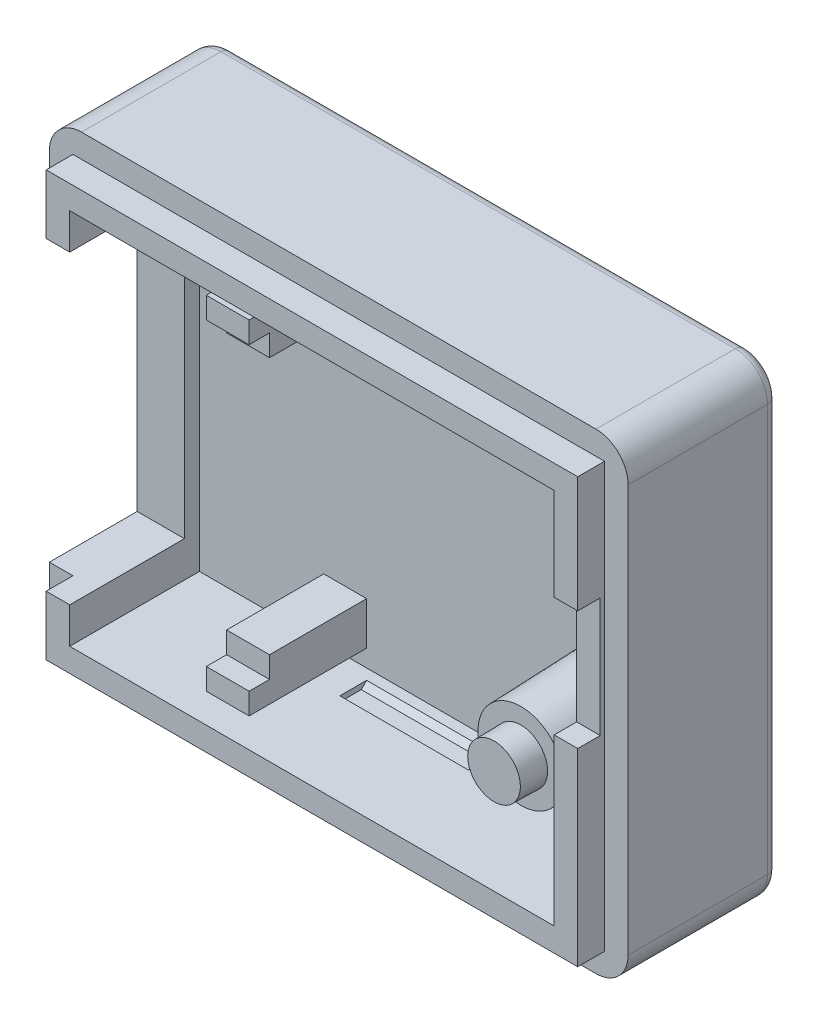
ISO-10303-21;
HEADER;
FILE_DESCRIPTION(('STEP AP214'),'2;1');
FILE_NAME('part.step','',(''),(''),'','','');
FILE_SCHEMA(('AUTOMOTIVE_DESIGN { 1 0 10303 214 1 1 1 1 }'));
ENDSEC;
DATA;
#1=APPLICATION_CONTEXT('core data for automotive mechanical design processes');
#2=APPLICATION_PROTOCOL_DEFINITION('international standard','automotive_design',2000,#1);
#3=PRODUCT_CONTEXT('',#1,'mechanical');
#4=PRODUCT('Part','Part','',(#3));
#5=PRODUCT_RELATED_PRODUCT_CATEGORY('part','',(#4));
#6=PRODUCT_DEFINITION_FORMATION('','',#4);
#7=PRODUCT_DEFINITION_CONTEXT('part definition',#1,'design');
#8=PRODUCT_DEFINITION('design','',#6,#7);
#9=PRODUCT_DEFINITION_SHAPE('','',#8);
#10=(LENGTH_UNIT() NAMED_UNIT(*) SI_UNIT(.MILLI.,.METRE.));
#11=(NAMED_UNIT(*) PLANE_ANGLE_UNIT() SI_UNIT($,.RADIAN.));
#12=(NAMED_UNIT(*) SI_UNIT($,.STERADIAN.) SOLID_ANGLE_UNIT());
#13=UNCERTAINTY_MEASURE_WITH_UNIT(LENGTH_MEASURE(1.E-05),#10,'distance_accuracy_value','');
#14=(GEOMETRIC_REPRESENTATION_CONTEXT(3) GLOBAL_UNCERTAINTY_ASSIGNED_CONTEXT((#13)) GLOBAL_UNIT_ASSIGNED_CONTEXT((#10,
#11,#12)) REPRESENTATION_CONTEXT('',''));
#15=CARTESIAN_POINT('',(0.,0.,0.));
#16=DIRECTION('',(0.,0.,1.));
#17=DIRECTION('',(1.,0.,0.));
#18=AXIS2_PLACEMENT_3D('',#15,#16,#17);
#19=CARTESIAN_POINT('',(0.,0.,1.25));
#20=DIRECTION('',(0.,0.,1.));
#21=DIRECTION('',(1.,0.,0.));
#22=AXIS2_PLACEMENT_3D('',#19,#20,#21);
#23=PLANE('',#22);
#24=DIRECTION('',(-1.,0.,0.));
#25=VECTOR('',#24,1.);
#26=CARTESIAN_POINT('',(0.,4.48,1.25));
#27=LINE('',#26,#25);
#28=CARTESIAN_POINT('',(12.4,4.48,1.25));
#29=VERTEX_POINT('',#28);
#30=CARTESIAN_POINT('',(11.3,4.48,1.25));
#31=VERTEX_POINT('',#30);
#32=EDGE_CURVE('E50',#29,#31,#27,.T.);
#33=ORIENTED_EDGE('',*,*,#32,.F.);
#34=DIRECTION('',(0.,-1.,0.));
#35=VECTOR('',#34,1.);
#36=CARTESIAN_POINT('',(12.4,0.,1.25));
#37=LINE('',#36,#35);
#38=CARTESIAN_POINT('',(12.4,9.9,1.25));
#39=VERTEX_POINT('',#38);
#40=EDGE_CURVE('E470',#39,#29,#37,.T.);
#41=ORIENTED_EDGE('',*,*,#40,.F.);
#42=DIRECTION('',(1.,0.,0.));
#43=VECTOR('',#42,1.);
#44=CARTESIAN_POINT('',(0.,9.9,1.25));
#45=LINE('',#44,#43);
#46=CARTESIAN_POINT('',(-12.4,9.9,1.25));
#47=VERTEX_POINT('',#46);
#48=EDGE_CURVE('E466',#47,#39,#45,.T.);
#49=ORIENTED_EDGE('',*,*,#48,.F.);
#50=DIRECTION('',(0.,1.,0.));
#51=VECTOR('',#50,1.);
#52=CARTESIAN_POINT('',(-12.4,0.,1.25));
#53=LINE('',#52,#51);
#54=CARTESIAN_POINT('',(-12.4,7.12500000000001,1.25));
#55=VERTEX_POINT('',#54);
#56=EDGE_CURVE('E463',#55,#47,#53,.T.);
#57=ORIENTED_EDGE('',*,*,#56,.F.);
#58=DIRECTION('',(-1.,0.,0.));
#59=VECTOR('',#58,1.);
#60=CARTESIAN_POINT('',(0.,7.12500000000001,1.25));
#61=LINE('',#60,#59);
#62=CARTESIAN_POINT('',(-11.3,7.12500000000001,1.25));
#63=VERTEX_POINT('',#62);
#64=EDGE_CURVE('E452',#63,#55,#61,.T.);
#65=ORIENTED_EDGE('',*,*,#64,.F.);
#66=DIRECTION('',(0.,-1.,0.));
#67=VECTOR('',#66,1.);
#68=CARTESIAN_POINT('',(-11.3,11.,1.25));
#69=LINE('',#68,#67);
#70=CARTESIAN_POINT('',(-11.3,8.8,1.25));
#71=VERTEX_POINT('',#70);
#72=EDGE_CURVE('E450',#71,#63,#69,.T.);
#73=ORIENTED_EDGE('',*,*,#72,.F.);
#74=DIRECTION('',(-1.,0.,0.));
#75=VECTOR('',#74,1.);
#76=CARTESIAN_POINT('',(13.5,8.8,1.25));
#77=LINE('',#76,#75);
#78=CARTESIAN_POINT('',(11.3,8.8,1.25));
#79=VERTEX_POINT('',#78);
#80=EDGE_CURVE('E455',#79,#71,#77,.T.);
#81=ORIENTED_EDGE('',*,*,#80,.F.);
#82=DIRECTION('',(0.,1.,0.));
#83=VECTOR('',#82,1.);
#84=CARTESIAN_POINT('',(11.3,11.,1.25));
#85=LINE('',#84,#83);
#86=EDGE_CURVE('E458',#31,#79,#85,.T.);
#87=ORIENTED_EDGE('',*,*,#86,.F.);
#88=EDGE_LOOP('',(#33,#41,#49,#57,#65,#73,#81,#87));
#89=FACE_BOUND('',#88,.T.);
#90=ADVANCED_FACE('F42',(#89),#23,.T.);
#91=CARTESIAN_POINT('',(0.,0.,0.));
#92=DIRECTION('',(0.,0.,1.));
#93=DIRECTION('',(1.,0.,0.));
#94=AXIS2_PLACEMENT_3D('',#91,#92,#93);
#95=PLANE('',#94);
#96=DIRECTION('',(-1.,0.,0.));
#97=VECTOR('',#96,1.);
#98=CARTESIAN_POINT('',(0.,-9.9,0.));
#99=LINE('',#98,#97);
#100=CARTESIAN_POINT('',(12.4,-9.9,0.));
#101=VERTEX_POINT('',#100);
#102=CARTESIAN_POINT('',(-12.4,-9.9,0.));
#103=VERTEX_POINT('',#102);
#104=EDGE_CURVE('E486',#101,#103,#99,.T.);
#105=ORIENTED_EDGE('',*,*,#104,.T.);
#106=DIRECTION('',(0.,1.,0.));
#107=VECTOR('',#106,1.);
#108=CARTESIAN_POINT('',(-12.4,0.,0.));
#109=LINE('',#108,#107);
#110=CARTESIAN_POINT('',(-12.4,-7.12499999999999,0.));
#111=VERTEX_POINT('',#110);
#112=EDGE_CURVE('E449',#103,#111,#109,.T.);
#113=ORIENTED_EDGE('',*,*,#112,.T.);
#114=DIRECTION('',(-1.,0.,0.));
#115=VECTOR('',#114,1.);
#116=CARTESIAN_POINT('',(0.,-7.12499999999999,0.));
#117=LINE('',#116,#115);
#118=CARTESIAN_POINT('',(-13.5,-7.12499999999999,0.));
#119=VERTEX_POINT('',#118);
#120=EDGE_CURVE('E622',#111,#119,#117,.T.);
#121=ORIENTED_EDGE('',*,*,#120,.T.);
#122=DIRECTION('',(0.,-1.,0.));
#123=VECTOR('',#122,1.);
#124=CARTESIAN_POINT('',(-13.5,11.,0.));
#125=LINE('',#124,#123);
#126=CARTESIAN_POINT('',(-13.5,-9.5,0.));
#127=VERTEX_POINT('',#126);
#128=EDGE_CURVE('E649',#119,#127,#125,.T.);
#129=ORIENTED_EDGE('',*,*,#128,.T.);
#130=CARTESIAN_POINT('',(-12.,-9.5,0.));
#131=DIRECTION('',(0.,0.,1.));
#132=DIRECTION('',(1.,0.,0.));
#133=AXIS2_PLACEMENT_3D('',#130,#131,#132);
#134=CIRCLE('',#133,1.5);
#135=CARTESIAN_POINT('',(-12.,-11.,0.));
#136=VERTEX_POINT('',#135);
#137=EDGE_CURVE('E838',#136,#127,#134,.F.);
#138=ORIENTED_EDGE('',*,*,#137,.F.);
#139=DIRECTION('',(1.,0.,0.));
#140=VECTOR('',#139,1.);
#141=CARTESIAN_POINT('',(13.5,-11.,0.));
#142=LINE('',#141,#140);
#143=CARTESIAN_POINT('',(12.,-11.,0.));
#144=VERTEX_POINT('',#143);
#145=EDGE_CURVE('E651',#136,#144,#142,.T.);
#146=ORIENTED_EDGE('',*,*,#145,.T.);
#147=CARTESIAN_POINT('',(12.,-9.5,0.));
#148=DIRECTION('',(0.,0.,1.));
#149=DIRECTION('',(1.,0.,0.));
#150=AXIS2_PLACEMENT_3D('',#147,#148,#149);
#151=CIRCLE('',#150,1.5);
#152=CARTESIAN_POINT('',(13.5,-9.5,0.));
#153=VERTEX_POINT('',#152);
#154=EDGE_CURVE('E857',#153,#144,#151,.F.);
#155=ORIENTED_EDGE('',*,*,#154,.F.);
#156=DIRECTION('',(0.,1.,0.));
#157=VECTOR('',#156,1.);
#158=CARTESIAN_POINT('',(13.5,11.,0.));
#159=LINE('',#158,#157);
#160=CARTESIAN_POINT('',(13.5,9.5,0.));
#161=VERTEX_POINT('',#160);
#162=EDGE_CURVE('E890',#153,#161,#159,.T.);
#163=ORIENTED_EDGE('',*,*,#162,.T.);
#164=CARTESIAN_POINT('',(12.,9.5,0.));
#165=DIRECTION('',(0.,0.,1.));
#166=DIRECTION('',(1.,0.,0.));
#167=AXIS2_PLACEMENT_3D('',#164,#165,#166);
#168=CIRCLE('',#167,1.5);
#169=CARTESIAN_POINT('',(12.,11.,0.));
#170=VERTEX_POINT('',#169);
#171=EDGE_CURVE('E877',#170,#161,#168,.F.);
#172=ORIENTED_EDGE('',*,*,#171,.F.);
#173=DIRECTION('',(-1.,0.,0.));
#174=VECTOR('',#173,1.);
#175=CARTESIAN_POINT('',(13.5,11.,0.));
#176=LINE('',#175,#174);
#177=CARTESIAN_POINT('',(-12.,11.,0.));
#178=VERTEX_POINT('',#177);
#179=EDGE_CURVE('E889',#170,#178,#176,.T.);
#180=ORIENTED_EDGE('',*,*,#179,.T.);
#181=CARTESIAN_POINT('',(-12.,9.5,0.));
#182=DIRECTION('',(0.,0.,1.));
#183=DIRECTION('',(1.,0.,0.));
#184=AXIS2_PLACEMENT_3D('',#181,#182,#183);
#185=CIRCLE('',#184,1.5);
#186=CARTESIAN_POINT('',(-13.5,9.5,0.));
#187=VERTEX_POINT('',#186);
#188=EDGE_CURVE('E648',#187,#178,#185,.F.);
#189=ORIENTED_EDGE('',*,*,#188,.F.);
#190=CARTESIAN_POINT('',(-13.5,7.12500000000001,0.));
#191=VERTEX_POINT('',#190);
#192=EDGE_CURVE('E644',#187,#191,#125,.T.);
#193=ORIENTED_EDGE('',*,*,#192,.T.);
#194=DIRECTION('',(-1.,0.,0.));
#195=VECTOR('',#194,1.);
#196=CARTESIAN_POINT('',(0.,7.12500000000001,0.));
#197=LINE('',#196,#195);
#198=CARTESIAN_POINT('',(-12.4,7.12500000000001,0.));
#199=VERTEX_POINT('',#198);
#200=EDGE_CURVE('E627',#199,#191,#197,.T.);
#201=ORIENTED_EDGE('',*,*,#200,.F.);
#202=DIRECTION('',(0.,1.,0.));
#203=VECTOR('',#202,1.);
#204=CARTESIAN_POINT('',(-12.4,0.,0.));
#205=LINE('',#204,#203);
#206=CARTESIAN_POINT('',(-12.4,9.9,0.));
#207=VERTEX_POINT('',#206);
#208=EDGE_CURVE('E444',#199,#207,#205,.T.);
#209=ORIENTED_EDGE('',*,*,#208,.T.);
#210=DIRECTION('',(1.,0.,0.));
#211=VECTOR('',#210,1.);
#212=CARTESIAN_POINT('',(0.,9.9,0.));
#213=LINE('',#212,#211);
#214=CARTESIAN_POINT('',(12.4,9.9,0.));
#215=VERTEX_POINT('',#214);
#216=EDGE_CURVE('E480',#207,#215,#213,.T.);
#217=ORIENTED_EDGE('',*,*,#216,.T.);
#218=DIRECTION('',(0.,-1.,0.));
#219=VECTOR('',#218,1.);
#220=CARTESIAN_POINT('',(12.4,0.,0.));
#221=LINE('',#220,#219);
#222=EDGE_CURVE('E483',#215,#101,#221,.T.);
#223=ORIENTED_EDGE('',*,*,#222,.T.);
#224=EDGE_LOOP('',(#105,#113,#121,#129,#138,#146,#155,#163,#172,#180,#189,#193,#201,#209,#217,#223));
#225=FACE_BOUND('',#224,.T.);
#226=ADVANCED_FACE('F791',(#225),#95,.T.);
#227=CARTESIAN_POINT('',(8.225,-4.22500000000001,-0.270000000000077));
#228=DIRECTION('',(0.,0.,1.));
#229=DIRECTION('',(-0.894427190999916,0.447213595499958,0.));
#230=AXIS2_PLACEMENT_3D('',#227,#228,#229);
#231=PLANE('',#230);
#232=DIRECTION('',(0.,1.,0.));
#233=VECTOR('',#232,1.);
#234=CARTESIAN_POINT('',(-5.5,0.,-0.270000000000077));
#235=LINE('',#234,#233);
#236=CARTESIAN_POINT('',(-5.5,-6.99999999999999,-0.270000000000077));
#237=VERTEX_POINT('',#236);
#238=CARTESIAN_POINT('',(-5.5,-5.99999999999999,-0.270000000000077));
#239=VERTEX_POINT('',#238);
#240=EDGE_CURVE('E732',#237,#239,#235,.T.);
#241=ORIENTED_EDGE('',*,*,#240,.F.);
#242=DIRECTION('',(1.,0.,0.));
#243=VECTOR('',#242,1.);
#244=CARTESIAN_POINT('',(8.225,-6.99999999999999,-0.270000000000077));
#245=LINE('',#244,#243);
#246=CARTESIAN_POINT('',(-3.5,-6.99999999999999,-0.270000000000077));
#247=VERTEX_POINT('',#246);
#248=EDGE_CURVE('E746',#237,#247,#245,.T.);
#249=ORIENTED_EDGE('',*,*,#248,.T.);
#250=DIRECTION('',(0.,1.,0.));
#251=VECTOR('',#250,1.);
#252=CARTESIAN_POINT('',(-3.49999999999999,0.,-0.270000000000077));
#253=LINE('',#252,#251);
#254=CARTESIAN_POINT('',(-3.5,-5.99999999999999,-0.270000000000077));
#255=VERTEX_POINT('',#254);
#256=EDGE_CURVE('E743',#247,#255,#253,.T.);
#257=ORIENTED_EDGE('',*,*,#256,.T.);
#258=DIRECTION('',(1.,0.,0.));
#259=VECTOR('',#258,1.);
#260=CARTESIAN_POINT('',(0.,-5.99999999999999,-0.270000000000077));
#261=LINE('',#260,#259);
#262=EDGE_CURVE('E737',#239,#255,#261,.T.);
#263=ORIENTED_EDGE('',*,*,#262,.F.);
#264=EDGE_LOOP('',(#241,#249,#257,#263));
#265=FACE_BOUND('',#264,.T.);
#266=ADVANCED_FACE('F936',(#265),#231,.T.);
#267=CARTESIAN_POINT('',(-11.3,11.,7.));
#268=DIRECTION('',(1.,0.,0.));
#269=DIRECTION('',(0.,1.,0.));
#270=AXIS2_PLACEMENT_3D('',#267,#268,#269);
#271=PLANE('',#270);
#272=DIRECTION('',(0.,1.,0.));
#273=VECTOR('',#272,1.);
#274=CARTESIAN_POINT('',(-11.3,11.,-4.09800000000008));
#275=LINE('',#274,#273);
#276=CARTESIAN_POINT('',(-11.3,-7.12499999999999,-4.09800000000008));
#277=VERTEX_POINT('',#276);
#278=CARTESIAN_POINT('',(-11.3,7.12500000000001,-4.09800000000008));
#279=VERTEX_POINT('',#278);
#280=EDGE_CURVE('E665',#277,#279,#275,.T.);
#281=ORIENTED_EDGE('',*,*,#280,.F.);
#282=DIRECTION('',(0.,0.,1.));
#283=VECTOR('',#282,1.);
#284=CARTESIAN_POINT('',(-11.3,-7.12499999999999,7.));
#285=LINE('',#284,#283);
#286=CARTESIAN_POINT('',(-11.3,-7.12499999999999,1.25));
#287=VERTEX_POINT('',#286);
#288=EDGE_CURVE('E626',#277,#287,#285,.T.);
#289=ORIENTED_EDGE('',*,*,#288,.T.);
#290=CARTESIAN_POINT('',(-11.3,-8.8,1.25));
#291=VERTEX_POINT('',#290);
#292=EDGE_CURVE('E445',#287,#291,#69,.T.);
#293=ORIENTED_EDGE('',*,*,#292,.T.);
#294=DIRECTION('',(0.,0.,1.));
#295=VECTOR('',#294,1.);
#296=CARTESIAN_POINT('',(-11.3,-8.8,7.));
#297=LINE('',#296,#295);
#298=CARTESIAN_POINT('',(-11.3,-8.8,-4.8));
#299=VERTEX_POINT('',#298);
#300=EDGE_CURVE('E533',#299,#291,#297,.T.);
#301=ORIENTED_EDGE('',*,*,#300,.F.);
#302=DIRECTION('',(0.,-1.,0.));
#303=VECTOR('',#302,1.);
#304=CARTESIAN_POINT('',(-11.3,0.,-4.8));
#305=LINE('',#304,#303);
#306=CARTESIAN_POINT('',(-11.3,8.8,-4.8));
#307=VERTEX_POINT('',#306);
#308=EDGE_CURVE('E535',#307,#299,#305,.T.);
#309=ORIENTED_EDGE('',*,*,#308,.F.);
#310=DIRECTION('',(0.,0.,1.));
#311=VECTOR('',#310,1.);
#312=CARTESIAN_POINT('',(-11.3,8.8,7.));
#313=LINE('',#312,#311);
#314=EDGE_CURVE('E518',#307,#71,#313,.T.);
#315=ORIENTED_EDGE('',*,*,#314,.T.);
#316=ORIENTED_EDGE('',*,*,#72,.T.);
#317=DIRECTION('',(0.,0.,1.));
#318=VECTOR('',#317,1.);
#319=CARTESIAN_POINT('',(-11.3,7.12500000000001,7.));
#320=LINE('',#319,#318);
#321=EDGE_CURVE('E663',#279,#63,#320,.T.);
#322=ORIENTED_EDGE('',*,*,#321,.F.);
#323=EDGE_LOOP('',(#281,#289,#293,#301,#309,#315,#316,#322));
#324=FACE_BOUND('',#323,.T.);
#325=ADVANCED_FACE('F905',(#324),#271,.T.);
#326=CARTESIAN_POINT('',(-13.5,11.,7.));
#327=DIRECTION('',(1.,0.,0.));
#328=DIRECTION('',(0.,1.,0.));
#329=AXIS2_PLACEMENT_3D('',#326,#327,#328);
#330=PLANE('',#329);
#331=DIRECTION('',(0.,0.,-1.));
#332=VECTOR('',#331,1.);
#333=CARTESIAN_POINT('',(-13.5,9.5,7.));
#334=LINE('',#333,#332);
#335=CARTESIAN_POINT('',(-13.5,9.5,-6.5));
#336=VERTEX_POINT('',#335);
#337=EDGE_CURVE('E551',#187,#336,#334,.T.);
#338=ORIENTED_EDGE('',*,*,#337,.T.);
#339=DIRECTION('',(0.,-1.,0.));
#340=VECTOR('',#339,1.);
#341=CARTESIAN_POINT('',(-13.5,-9.5,-6.5));
#342=LINE('',#341,#340);
#343=CARTESIAN_POINT('',(-13.5,-9.5,-6.5));
#344=VERTEX_POINT('',#343);
#345=EDGE_CURVE('E585',#336,#344,#342,.T.);
#346=ORIENTED_EDGE('',*,*,#345,.T.);
#347=DIRECTION('',(0.,0.,-1.));
#348=VECTOR('',#347,1.);
#349=CARTESIAN_POINT('',(-13.5,-9.5,7.));
#350=LINE('',#349,#348);
#351=EDGE_CURVE('E554',#344,#127,#350,.F.);
#352=ORIENTED_EDGE('',*,*,#351,.T.);
#353=ORIENTED_EDGE('',*,*,#128,.F.);
#354=DIRECTION('',(0.,0.,1.));
#355=VECTOR('',#354,1.);
#356=CARTESIAN_POINT('',(-13.5,-7.12499999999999,7.));
#357=LINE('',#356,#355);
#358=CARTESIAN_POINT('',(-13.5,-7.12499999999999,-4.09800000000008));
#359=VERTEX_POINT('',#358);
#360=EDGE_CURVE('E562',#359,#119,#357,.T.);
#361=ORIENTED_EDGE('',*,*,#360,.F.);
#362=DIRECTION('',(0.,-1.,0.));
#363=VECTOR('',#362,1.);
#364=CARTESIAN_POINT('',(-13.5,0.,-4.09800000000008));
#365=LINE('',#364,#363);
#366=CARTESIAN_POINT('',(-13.5,7.12500000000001,-4.09800000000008));
#367=VERTEX_POINT('',#366);
#368=EDGE_CURVE('E621',#367,#359,#365,.T.);
#369=ORIENTED_EDGE('',*,*,#368,.F.);
#370=DIRECTION('',(0.,0.,1.));
#371=VECTOR('',#370,1.);
#372=CARTESIAN_POINT('',(-13.5,7.12500000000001,7.));
#373=LINE('',#372,#371);
#374=EDGE_CURVE('E559',#367,#191,#373,.T.);
#375=ORIENTED_EDGE('',*,*,#374,.T.);
#376=ORIENTED_EDGE('',*,*,#192,.F.);
#377=EDGE_LOOP('',(#338,#346,#352,#353,#361,#369,#375,#376));
#378=FACE_BOUND('',#377,.T.);
#379=ADVANCED_FACE('F814',(#378),#330,.F.);
#380=CARTESIAN_POINT('',(13.5,-8.8,7.));
#381=DIRECTION('',(0.,1.,0.));
#382=DIRECTION('',(-1.,0.,0.));
#383=AXIS2_PLACEMENT_3D('',#380,#381,#382);
#384=PLANE('',#383);
#385=DIRECTION('',(0.,0.,1.));
#386=VECTOR('',#385,1.);
#387=CARTESIAN_POINT('',(-3.,-8.8,-4.3));
#388=LINE('',#387,#386);
#389=CARTESIAN_POINT('',(-3.,-8.8,-4.3));
#390=VERTEX_POINT('',#389);
#391=CARTESIAN_POINT('',(-3.,-8.8,-3.05));
#392=VERTEX_POINT('',#391);
#393=EDGE_CURVE('E433',#390,#392,#388,.T.);
#394=ORIENTED_EDGE('',*,*,#393,.F.);
#395=DIRECTION('',(-1.,0.,0.));
#396=VECTOR('',#395,1.);
#397=CARTESIAN_POINT('',(4.2747548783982,-8.8,-4.3));
#398=LINE('',#397,#396);
#399=CARTESIAN_POINT('',(3.,-8.8,-4.3));
#400=VERTEX_POINT('',#399);
#401=EDGE_CURVE('E419',#400,#390,#398,.T.);
#402=ORIENTED_EDGE('',*,*,#401,.F.);
#403=DIRECTION('',(0.,0.,-1.));
#404=VECTOR('',#403,1.);
#405=CARTESIAN_POINT('',(3.,-8.8,-4.3));
#406=LINE('',#405,#404);
#407=CARTESIAN_POINT('',(3.,-8.8,-3.05));
#408=VERTEX_POINT('',#407);
#409=EDGE_CURVE('E418',#408,#400,#406,.T.);
#410=ORIENTED_EDGE('',*,*,#409,.F.);
#411=DIRECTION('',(-1.,0.,0.));
#412=VECTOR('',#411,1.);
#413=CARTESIAN_POINT('',(4.2747548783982,-8.8,-3.05));
#414=LINE('',#413,#412);
#415=EDGE_CURVE('E437',#408,#392,#414,.T.);
#416=ORIENTED_EDGE('',*,*,#415,.T.);
#417=EDGE_LOOP('',(#394,#402,#410,#416));
#418=FACE_BOUND('',#417,.T.);
#419=ORIENTED_EDGE('',*,*,#300,.T.);
#420=DIRECTION('',(1.,0.,0.));
#421=VECTOR('',#420,1.);
#422=CARTESIAN_POINT('',(13.5,-8.8,1.25));
#423=LINE('',#422,#421);
#424=CARTESIAN_POINT('',(11.3,-8.8,1.25));
#425=VERTEX_POINT('',#424);
#426=EDGE_CURVE('E460',#291,#425,#423,.T.);
#427=ORIENTED_EDGE('',*,*,#426,.T.);
#428=DIRECTION('',(0.,0.,1.));
#429=VECTOR('',#428,1.);
#430=CARTESIAN_POINT('',(11.3,-8.8,7.));
#431=LINE('',#430,#429);
#432=CARTESIAN_POINT('',(11.3,-8.8,-4.8));
#433=VERTEX_POINT('',#432);
#434=EDGE_CURVE('E525',#433,#425,#431,.T.);
#435=ORIENTED_EDGE('',*,*,#434,.F.);
#436=DIRECTION('',(1.,0.,0.));
#437=VECTOR('',#436,1.);
#438=CARTESIAN_POINT('',(0.,-8.8,-4.8));
#439=LINE('',#438,#437);
#440=EDGE_CURVE('E532',#299,#433,#439,.T.);
#441=ORIENTED_EDGE('',*,*,#440,.F.);
#442=EDGE_LOOP('',(#419,#427,#435,#441));
#443=FACE_BOUND('',#442,.T.);
#444=ADVANCED_FACE('F917',(#418,#443),#384,.T.);
#445=CARTESIAN_POINT('',(0.,0.,-4.8));
#446=DIRECTION('',(0.,0.,-1.));
#447=DIRECTION('',(-1.,0.,0.));
#448=AXIS2_PLACEMENT_3D('',#445,#446,#447);
#449=PLANE('',#448);
#450=DIRECTION('',(0.,1.,0.));
#451=VECTOR('',#450,1.);
#452=CARTESIAN_POINT('',(-5.5,0.,-4.8));
#453=LINE('',#452,#451);
#454=CARTESIAN_POINT('',(-5.5,-7.99999999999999,-4.8));
#455=VERTEX_POINT('',#454);
#456=CARTESIAN_POINT('',(-5.5,-5.99999999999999,-4.8));
#457=VERTEX_POINT('',#456);
#458=EDGE_CURVE('E745',#455,#457,#453,.T.);
#459=ORIENTED_EDGE('',*,*,#458,.T.);
#460=DIRECTION('',(1.,0.,0.));
#461=VECTOR('',#460,1.);
#462=CARTESIAN_POINT('',(0.,-5.99999999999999,-4.8));
#463=LINE('',#462,#461);
#464=CARTESIAN_POINT('',(-3.5,-5.99999999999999,-4.8));
#465=VERTEX_POINT('',#464);
#466=EDGE_CURVE('E750',#457,#465,#463,.T.);
#467=ORIENTED_EDGE('',*,*,#466,.T.);
#468=DIRECTION('',(0.,1.,0.));
#469=VECTOR('',#468,1.);
#470=CARTESIAN_POINT('',(-3.49999999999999,0.,-4.8));
#471=LINE('',#470,#469);
#472=CARTESIAN_POINT('',(-3.5,-7.99999999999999,-4.8));
#473=VERTEX_POINT('',#472);
#474=EDGE_CURVE('E739',#473,#465,#471,.T.);
#475=ORIENTED_EDGE('',*,*,#474,.F.);
#476=DIRECTION('',(1.,0.,0.));
#477=VECTOR('',#476,1.);
#478=CARTESIAN_POINT('',(0.,-7.99999999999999,-4.8));
#479=LINE('',#478,#477);
#480=EDGE_CURVE('E742',#455,#473,#479,.T.);
#481=ORIENTED_EDGE('',*,*,#480,.F.);
#482=EDGE_LOOP('',(#459,#467,#475,#481));
#483=FACE_BOUND('',#482,.T.);
#484=DIRECTION('',(0.,-1.,0.));
#485=VECTOR('',#484,1.);
#486=CARTESIAN_POINT('',(-5.5,0.,-4.8));
#487=LINE('',#486,#485);
#488=CARTESIAN_POINT('',(-5.5,7.99999999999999,-4.8));
#489=VERTEX_POINT('',#488);
#490=CARTESIAN_POINT('',(-5.5,5.99999999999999,-4.8));
#491=VERTEX_POINT('',#490);
#492=EDGE_CURVE('E601',#489,#491,#487,.T.);
#493=ORIENTED_EDGE('',*,*,#492,.F.);
#494=DIRECTION('',(1.,0.,0.));
#495=VECTOR('',#494,1.);
#496=CARTESIAN_POINT('',(0.,7.99999999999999,-4.8));
#497=LINE('',#496,#495);
#498=CARTESIAN_POINT('',(-3.5,7.99999999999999,-4.8));
#499=VERTEX_POINT('',#498);
#500=EDGE_CURVE('E701',#489,#499,#497,.T.);
#501=ORIENTED_EDGE('',*,*,#500,.T.);
#502=DIRECTION('',(0.,-1.,0.));
#503=VECTOR('',#502,1.);
#504=CARTESIAN_POINT('',(-3.49999999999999,0.,-4.8));
#505=LINE('',#504,#503);
#506=CARTESIAN_POINT('',(-3.5,5.99999999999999,-4.8));
#507=VERTEX_POINT('',#506);
#508=EDGE_CURVE('E690',#499,#507,#505,.T.);
#509=ORIENTED_EDGE('',*,*,#508,.T.);
#510=DIRECTION('',(1.,0.,0.));
#511=VECTOR('',#510,1.);
#512=CARTESIAN_POINT('',(0.,5.99999999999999,-4.8));
#513=LINE('',#512,#511);
#514=EDGE_CURVE('E685',#491,#507,#513,.T.);
#515=ORIENTED_EDGE('',*,*,#514,.F.);
#516=EDGE_LOOP('',(#493,#501,#509,#515));
#517=FACE_BOUND('',#516,.T.);
#518=CARTESIAN_POINT('',(8.225,-4.22500000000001,-4.8));
#519=DIRECTION('',(0.,0.,-1.));
#520=DIRECTION('',(-1.,0.,0.));
#521=AXIS2_PLACEMENT_3D('',#518,#519,#520);
#522=CIRCLE('',#521,2.15819108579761);
#523=CARTESIAN_POINT('',(6.06680891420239,-4.22500000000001,-4.8));
#524=VERTEX_POINT('',#523);
#525=EDGE_CURVE('E891',#524,#524,#522,.F.);
#526=ORIENTED_EDGE('',*,*,#525,.F.);
#527=EDGE_LOOP('',(#526));
#528=FACE_BOUND('',#527,.T.);
#529=ORIENTED_EDGE('',*,*,#308,.T.);
#530=ORIENTED_EDGE('',*,*,#440,.T.);
#531=DIRECTION('',(0.,1.,0.));
#532=VECTOR('',#531,1.);
#533=CARTESIAN_POINT('',(11.3,0.,-4.8));
#534=LINE('',#533,#532);
#535=CARTESIAN_POINT('',(11.3,8.8,-4.8));
#536=VERTEX_POINT('',#535);
#537=EDGE_CURVE('E523',#433,#536,#534,.T.);
#538=ORIENTED_EDGE('',*,*,#537,.T.);
#539=DIRECTION('',(-1.,0.,0.));
#540=VECTOR('',#539,1.);
#541=CARTESIAN_POINT('',(0.,8.8,-4.8));
#542=LINE('',#541,#540);
#543=EDGE_CURVE('E521',#536,#307,#542,.T.);
#544=ORIENTED_EDGE('',*,*,#543,.T.);
#545=EDGE_LOOP('',(#529,#530,#538,#544));
#546=FACE_BOUND('',#545,.T.);
#547=ADVANCED_FACE('F909',(#483,#517,#528,#546),#449,.F.);
#548=CARTESIAN_POINT('',(11.3,11.,7.));
#549=DIRECTION('',(-1.,0.,0.));
#550=DIRECTION('',(0.,-1.,0.));
#551=AXIS2_PLACEMENT_3D('',#548,#549,#550);
#552=PLANE('',#551);
#553=DIRECTION('',(0.,0.,-1.));
#554=VECTOR('',#553,1.);
#555=CARTESIAN_POINT('',(11.3,4.48,7.));
#556=LINE('',#555,#554);
#557=CARTESIAN_POINT('',(11.3,4.48,0.199999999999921));
#558=VERTEX_POINT('',#557);
#559=EDGE_CURVE('E370',#31,#558,#556,.T.);
#560=ORIENTED_EDGE('',*,*,#559,.F.);
#561=ORIENTED_EDGE('',*,*,#86,.T.);
#562=DIRECTION('',(0.,0.,1.));
#563=VECTOR('',#562,1.);
#564=CARTESIAN_POINT('',(11.3,8.8,7.));
#565=LINE('',#564,#563);
#566=EDGE_CURVE('E520',#536,#79,#565,.T.);
#567=ORIENTED_EDGE('',*,*,#566,.F.);
#568=ORIENTED_EDGE('',*,*,#537,.F.);
#569=ORIENTED_EDGE('',*,*,#434,.T.);
#570=CARTESIAN_POINT('',(11.3,-1.08,1.25));
#571=VERTEX_POINT('',#570);
#572=EDGE_CURVE('E379',#425,#571,#85,.T.);
#573=ORIENTED_EDGE('',*,*,#572,.T.);
#574=DIRECTION('',(0.,0.,1.));
#575=VECTOR('',#574,1.);
#576=CARTESIAN_POINT('',(11.3,-1.08,7.));
#577=LINE('',#576,#575);
#578=CARTESIAN_POINT('',(11.3,-1.08,0.199999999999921));
#579=VERTEX_POINT('',#578);
#580=EDGE_CURVE('E57',#579,#571,#577,.T.);
#581=ORIENTED_EDGE('',*,*,#580,.F.);
#582=DIRECTION('',(0.,-1.,0.));
#583=VECTOR('',#582,1.);
#584=CARTESIAN_POINT('',(11.3,11.,0.199999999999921));
#585=LINE('',#584,#583);
#586=EDGE_CURVE('E361',#558,#579,#585,.T.);
#587=ORIENTED_EDGE('',*,*,#586,.F.);
#588=EDGE_LOOP('',(#560,#561,#567,#568,#569,#573,#581,#587));
#589=FACE_BOUND('',#588,.T.);
#590=ADVANCED_FACE('F377',(#589),#552,.T.);
#591=CARTESIAN_POINT('',(13.5,8.8,7.));
#592=DIRECTION('',(0.,-1.,0.));
#593=DIRECTION('',(1.,0.,0.));
#594=AXIS2_PLACEMENT_3D('',#591,#592,#593);
#595=PLANE('',#594);
#596=DIRECTION('',(0.,0.,1.));
#597=VECTOR('',#596,1.);
#598=CARTESIAN_POINT('',(-3.,8.8,-4.3));
#599=LINE('',#598,#597);
#600=CARTESIAN_POINT('',(-3.,8.8,-4.3));
#601=VERTEX_POINT('',#600);
#602=CARTESIAN_POINT('',(-3.,8.8,-3.05));
#603=VERTEX_POINT('',#602);
#604=EDGE_CURVE('E406',#601,#603,#599,.T.);
#605=ORIENTED_EDGE('',*,*,#604,.T.);
#606=DIRECTION('',(-1.,0.,0.));
#607=VECTOR('',#606,1.);
#608=CARTESIAN_POINT('',(4.2747548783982,8.8,-3.05));
#609=LINE('',#608,#607);
#610=CARTESIAN_POINT('',(3.,8.8,-3.05));
#611=VERTEX_POINT('',#610);
#612=EDGE_CURVE('E411',#611,#603,#609,.T.);
#613=ORIENTED_EDGE('',*,*,#612,.F.);
#614=DIRECTION('',(0.,0.,-1.));
#615=VECTOR('',#614,1.);
#616=CARTESIAN_POINT('',(3.,8.8,-4.3));
#617=LINE('',#616,#615);
#618=CARTESIAN_POINT('',(3.,8.8,-4.3));
#619=VERTEX_POINT('',#618);
#620=EDGE_CURVE('E369',#611,#619,#617,.T.);
#621=ORIENTED_EDGE('',*,*,#620,.T.);
#622=DIRECTION('',(-1.,0.,0.));
#623=VECTOR('',#622,1.);
#624=CARTESIAN_POINT('',(4.2747548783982,8.8,-4.3));
#625=LINE('',#624,#623);
#626=EDGE_CURVE('E65',#619,#601,#625,.T.);
#627=ORIENTED_EDGE('',*,*,#626,.T.);
#628=EDGE_LOOP('',(#605,#613,#621,#627));
#629=FACE_BOUND('',#628,.T.);
#630=ORIENTED_EDGE('',*,*,#566,.T.);
#631=ORIENTED_EDGE('',*,*,#80,.T.);
#632=ORIENTED_EDGE('',*,*,#314,.F.);
#633=ORIENTED_EDGE('',*,*,#543,.F.);
#634=EDGE_LOOP('',(#630,#631,#632,#633));
#635=FACE_BOUND('',#634,.T.);
#636=ADVANCED_FACE('F516',(#629,#635),#595,.T.);
#637=CARTESIAN_POINT('',(0.,0.,-7.));
#638=DIRECTION('',(0.,0.,-1.));
#639=DIRECTION('',(-1.,0.,0.));
#640=AXIS2_PLACEMENT_3D('',#637,#638,#639);
#641=PLANE('',#640);
#642=DIRECTION('',(1.,0.,0.));
#643=VECTOR('',#642,1.);
#644=CARTESIAN_POINT('',(-12.,-10.5,-7.));
#645=LINE('',#644,#643);
#646=CARTESIAN_POINT('',(12.,-10.5,-7.));
#647=VERTEX_POINT('',#646);
#648=CARTESIAN_POINT('',(-12.,-10.5,-7.));
#649=VERTEX_POINT('',#648);
#650=EDGE_CURVE('E565',#647,#649,#645,.F.);
#651=ORIENTED_EDGE('',*,*,#650,.T.);
#652=CARTESIAN_POINT('',(-12.,-9.5,-7.));
#653=DIRECTION('',(0.,0.,-1.));
#654=DIRECTION('',(-1.,0.,0.));
#655=AXIS2_PLACEMENT_3D('',#652,#653,#654);
#656=CIRCLE('',#655,1.);
#657=CARTESIAN_POINT('',(-13.,-9.5,-7.));
#658=VERTEX_POINT('',#657);
#659=EDGE_CURVE('E579',#649,#658,#656,.T.);
#660=ORIENTED_EDGE('',*,*,#659,.T.);
#661=DIRECTION('',(0.,-1.,0.));
#662=VECTOR('',#661,1.);
#663=CARTESIAN_POINT('',(-13.,9.5,-7.));
#664=LINE('',#663,#662);
#665=CARTESIAN_POINT('',(-13.,9.5,-7.));
#666=VERTEX_POINT('',#665);
#667=EDGE_CURVE('E577',#658,#666,#664,.F.);
#668=ORIENTED_EDGE('',*,*,#667,.T.);
#669=CARTESIAN_POINT('',(-12.,9.5,-7.));
#670=DIRECTION('',(0.,0.,-1.));
#671=DIRECTION('',(-1.,0.,0.));
#672=AXIS2_PLACEMENT_3D('',#669,#670,#671);
#673=CIRCLE('',#672,1.);
#674=CARTESIAN_POINT('',(-12.,10.5,-7.));
#675=VERTEX_POINT('',#674);
#676=EDGE_CURVE('E575',#666,#675,#673,.T.);
#677=ORIENTED_EDGE('',*,*,#676,.T.);
#678=DIRECTION('',(-1.,0.,0.));
#679=VECTOR('',#678,1.);
#680=CARTESIAN_POINT('',(12.,10.5,-7.));
#681=LINE('',#680,#679);
#682=CARTESIAN_POINT('',(12.,10.5,-7.));
#683=VERTEX_POINT('',#682);
#684=EDGE_CURVE('E573',#675,#683,#681,.F.);
#685=ORIENTED_EDGE('',*,*,#684,.T.);
#686=CARTESIAN_POINT('',(12.,9.5,-7.));
#687=DIRECTION('',(0.,0.,-1.));
#688=DIRECTION('',(-1.,0.,0.));
#689=AXIS2_PLACEMENT_3D('',#686,#687,#688);
#690=CIRCLE('',#689,1.);
#691=CARTESIAN_POINT('',(13.,9.5,-7.));
#692=VERTEX_POINT('',#691);
#693=EDGE_CURVE('E571',#683,#692,#690,.T.);
#694=ORIENTED_EDGE('',*,*,#693,.T.);
#695=DIRECTION('',(0.,1.,0.));
#696=VECTOR('',#695,1.);
#697=CARTESIAN_POINT('',(13.,-9.5,-7.));
#698=LINE('',#697,#696);
#699=CARTESIAN_POINT('',(13.,-9.5,-7.));
#700=VERTEX_POINT('',#699);
#701=EDGE_CURVE('E569',#692,#700,#698,.F.);
#702=ORIENTED_EDGE('',*,*,#701,.T.);
#703=CARTESIAN_POINT('',(12.,-9.5,-7.));
#704=DIRECTION('',(0.,0.,-1.));
#705=DIRECTION('',(-1.,0.,0.));
#706=AXIS2_PLACEMENT_3D('',#703,#704,#705);
#707=CIRCLE('',#706,1.);
#708=EDGE_CURVE('E567',#700,#647,#707,.T.);
#709=ORIENTED_EDGE('',*,*,#708,.T.);
#710=EDGE_LOOP('',(#651,#660,#668,#677,#685,#694,#702,#709));
#711=FACE_BOUND('',#710,.T.);
#712=ADVANCED_FACE('F1035',(#711),#641,.T.);
#713=CARTESIAN_POINT('',(13.5,-11.,7.));
#714=DIRECTION('',(0.,1.,0.));
#715=DIRECTION('',(-1.,0.,0.));
#716=AXIS2_PLACEMENT_3D('',#713,#714,#715);
#717=PLANE('',#716);
#718=DIRECTION('',(0.,0.,-1.));
#719=VECTOR('',#718,1.);
#720=CARTESIAN_POINT('',(-12.,-11.,7.));
#721=LINE('',#720,#719);
#722=CARTESIAN_POINT('',(-12.,-11.,-6.5));
#723=VERTEX_POINT('',#722);
#724=EDGE_CURVE('E538',#136,#723,#721,.T.);
#725=ORIENTED_EDGE('',*,*,#724,.T.);
#726=DIRECTION('',(1.,0.,0.));
#727=VECTOR('',#726,1.);
#728=CARTESIAN_POINT('',(12.,-11.,-6.5));
#729=LINE('',#728,#727);
#730=CARTESIAN_POINT('',(12.,-11.,-6.5));
#731=VERTEX_POINT('',#730);
#732=EDGE_CURVE('E500',#723,#731,#729,.T.);
#733=ORIENTED_EDGE('',*,*,#732,.T.);
#734=DIRECTION('',(0.,0.,-1.));
#735=VECTOR('',#734,1.);
#736=CARTESIAN_POINT('',(12.,-11.,7.));
#737=LINE('',#736,#735);
#738=EDGE_CURVE('E536',#731,#144,#737,.F.);
#739=ORIENTED_EDGE('',*,*,#738,.T.);
#740=ORIENTED_EDGE('',*,*,#145,.F.);
#741=EDGE_LOOP('',(#725,#733,#739,#740));
#742=FACE_BOUND('',#741,.T.);
#743=ADVANCED_FACE('F850',(#742),#717,.F.);
#744=CARTESIAN_POINT('',(-12.,-9.5,7.));
#745=DIRECTION('',(0.,0.,-1.));
#746=DIRECTION('',(-1.,0.,0.));
#747=AXIS2_PLACEMENT_3D('',#744,#745,#746);
#748=CYLINDRICAL_SURFACE('',#747,1.5);
#749=ORIENTED_EDGE('',*,*,#351,.F.);
#750=CARTESIAN_POINT('',(-12.,-9.5,-6.5));
#751=DIRECTION('',(0.,0.,-1.));
#752=DIRECTION('',(-1.,0.,0.));
#753=AXIS2_PLACEMENT_3D('',#750,#751,#752);
#754=CIRCLE('',#753,1.5);
#755=EDGE_CURVE('E582',#344,#723,#754,.F.);
#756=ORIENTED_EDGE('',*,*,#755,.T.);
#757=ORIENTED_EDGE('',*,*,#724,.F.);
#758=ORIENTED_EDGE('',*,*,#137,.T.);
#759=EDGE_LOOP('',(#749,#756,#757,#758));
#760=FACE_BOUND('',#759,.T.);
#761=ADVANCED_FACE('F836',(#760),#748,.T.);
#762=CARTESIAN_POINT('',(13.5,11.,7.));
#763=DIRECTION('',(-1.,0.,0.));
#764=DIRECTION('',(0.,-1.,0.));
#765=AXIS2_PLACEMENT_3D('',#762,#763,#764);
#766=PLANE('',#765);
#767=DIRECTION('',(0.,0.,-1.));
#768=VECTOR('',#767,1.);
#769=CARTESIAN_POINT('',(13.5,-9.5,7.));
#770=LINE('',#769,#768);
#771=CARTESIAN_POINT('',(13.5,-9.5,-6.5));
#772=VERTEX_POINT('',#771);
#773=EDGE_CURVE('E543',#153,#772,#770,.T.);
#774=ORIENTED_EDGE('',*,*,#773,.T.);
#775=DIRECTION('',(0.,1.,0.));
#776=VECTOR('',#775,1.);
#777=CARTESIAN_POINT('',(13.5,9.5,-6.5));
#778=LINE('',#777,#776);
#779=CARTESIAN_POINT('',(13.5,9.5,-6.5));
#780=VERTEX_POINT('',#779);
#781=EDGE_CURVE('E593',#772,#780,#778,.T.);
#782=ORIENTED_EDGE('',*,*,#781,.T.);
#783=DIRECTION('',(0.,0.,-1.));
#784=VECTOR('',#783,1.);
#785=CARTESIAN_POINT('',(13.5,9.5,7.));
#786=LINE('',#785,#784);
#787=EDGE_CURVE('E541',#780,#161,#786,.F.);
#788=ORIENTED_EDGE('',*,*,#787,.T.);
#789=ORIENTED_EDGE('',*,*,#162,.F.);
#790=EDGE_LOOP('',(#774,#782,#788,#789));
#791=FACE_BOUND('',#790,.T.);
#792=ADVANCED_FACE('F870',(#791),#766,.F.);
#793=CARTESIAN_POINT('',(12.,-9.5,7.));
#794=DIRECTION('',(0.,0.,-1.));
#795=DIRECTION('',(-1.,0.,0.));
#796=AXIS2_PLACEMENT_3D('',#793,#794,#795);
#797=CYLINDRICAL_SURFACE('',#796,1.5);
#798=ORIENTED_EDGE('',*,*,#738,.F.);
#799=CARTESIAN_POINT('',(12.,-9.5,-6.5));
#800=DIRECTION('',(0.,0.,-1.));
#801=DIRECTION('',(-1.,0.,0.));
#802=AXIS2_PLACEMENT_3D('',#799,#800,#801);
#803=CIRCLE('',#802,1.5);
#804=EDGE_CURVE('E595',#731,#772,#803,.F.);
#805=ORIENTED_EDGE('',*,*,#804,.T.);
#806=ORIENTED_EDGE('',*,*,#773,.F.);
#807=ORIENTED_EDGE('',*,*,#154,.T.);
#808=EDGE_LOOP('',(#798,#805,#806,#807));
#809=FACE_BOUND('',#808,.T.);
#810=ADVANCED_FACE('F855',(#809),#797,.T.);
#811=CARTESIAN_POINT('',(13.5,11.,7.));
#812=DIRECTION('',(0.,-1.,0.));
#813=DIRECTION('',(1.,0.,0.));
#814=AXIS2_PLACEMENT_3D('',#811,#812,#813);
#815=PLANE('',#814);
#816=DIRECTION('',(0.,0.,-1.));
#817=VECTOR('',#816,1.);
#818=CARTESIAN_POINT('',(12.,11.,7.));
#819=LINE('',#818,#817);
#820=CARTESIAN_POINT('',(12.,11.,-6.5));
#821=VERTEX_POINT('',#820);
#822=EDGE_CURVE('E548',#170,#821,#819,.T.);
#823=ORIENTED_EDGE('',*,*,#822,.T.);
#824=DIRECTION('',(-1.,0.,0.));
#825=VECTOR('',#824,1.);
#826=CARTESIAN_POINT('',(-12.,11.,-6.5));
#827=LINE('',#826,#825);
#828=CARTESIAN_POINT('',(-12.,11.,-6.5));
#829=VERTEX_POINT('',#828);
#830=EDGE_CURVE('E589',#821,#829,#827,.T.);
#831=ORIENTED_EDGE('',*,*,#830,.T.);
#832=DIRECTION('',(0.,0.,-1.));
#833=VECTOR('',#832,1.);
#834=CARTESIAN_POINT('',(-12.,11.,7.));
#835=LINE('',#834,#833);
#836=EDGE_CURVE('E546',#829,#178,#835,.F.);
#837=ORIENTED_EDGE('',*,*,#836,.T.);
#838=ORIENTED_EDGE('',*,*,#179,.F.);
#839=EDGE_LOOP('',(#823,#831,#837,#838));
#840=FACE_BOUND('',#839,.T.);
#841=ADVANCED_FACE('F887',(#840),#815,.F.);
#842=CARTESIAN_POINT('',(12.,9.5,7.));
#843=DIRECTION('',(0.,0.,-1.));
#844=DIRECTION('',(-1.,0.,0.));
#845=AXIS2_PLACEMENT_3D('',#842,#843,#844);
#846=CYLINDRICAL_SURFACE('',#845,1.5);
#847=ORIENTED_EDGE('',*,*,#787,.F.);
#848=CARTESIAN_POINT('',(12.,9.5,-6.5));
#849=DIRECTION('',(0.,0.,-1.));
#850=DIRECTION('',(-1.,0.,0.));
#851=AXIS2_PLACEMENT_3D('',#848,#849,#850);
#852=CIRCLE('',#851,1.5);
#853=EDGE_CURVE('E591',#780,#821,#852,.F.);
#854=ORIENTED_EDGE('',*,*,#853,.T.);
#855=ORIENTED_EDGE('',*,*,#822,.F.);
#856=ORIENTED_EDGE('',*,*,#171,.T.);
#857=EDGE_LOOP('',(#847,#854,#855,#856));
#858=FACE_BOUND('',#857,.T.);
#859=ADVANCED_FACE('F875',(#858),#846,.T.);
#860=CARTESIAN_POINT('',(-12.,9.5,7.));
#861=DIRECTION('',(0.,0.,-1.));
#862=DIRECTION('',(-1.,0.,0.));
#863=AXIS2_PLACEMENT_3D('',#860,#861,#862);
#864=CYLINDRICAL_SURFACE('',#863,1.5);
#865=ORIENTED_EDGE('',*,*,#836,.F.);
#866=CARTESIAN_POINT('',(-12.,9.5,-6.5));
#867=DIRECTION('',(0.,0.,-1.));
#868=DIRECTION('',(-1.,0.,0.));
#869=AXIS2_PLACEMENT_3D('',#866,#867,#868);
#870=CIRCLE('',#869,1.5);
#871=EDGE_CURVE('E587',#829,#336,#870,.F.);
#872=ORIENTED_EDGE('',*,*,#871,.T.);
#873=ORIENTED_EDGE('',*,*,#337,.F.);
#874=ORIENTED_EDGE('',*,*,#188,.T.);
#875=EDGE_LOOP('',(#865,#872,#873,#874));
#876=FACE_BOUND('',#875,.T.);
#877=ADVANCED_FACE('F819',(#876),#864,.T.);
#878=CARTESIAN_POINT('',(8.225,-4.22500000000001,-0.270000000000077));
#879=DIRECTION('',(0.,0.,1.));
#880=DIRECTION('',(-0.894427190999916,0.447213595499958,0.));
#881=AXIS2_PLACEMENT_3D('',#878,#879,#880);
#882=PLANE('',#881);
#883=CARTESIAN_POINT('',(8.225,-4.22500000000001,-0.270000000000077));
#884=DIRECTION('',(0.,0.,1.));
#885=DIRECTION('',(1.,0.,0.));
#886=AXIS2_PLACEMENT_3D('',#883,#884,#885);
#887=CIRCLE('',#886,1.25);
#888=CARTESIAN_POINT('',(9.475,-4.22500000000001,-0.270000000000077));
#889=VERTEX_POINT('',#888);
#890=EDGE_CURVE('E556',#889,#889,#887,.T.);
#891=ORIENTED_EDGE('',*,*,#890,.F.);
#892=EDGE_LOOP('',(#891));
#893=FACE_BOUND('',#892,.T.);
#894=CARTESIAN_POINT('',(8.225,-4.22500000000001,-0.270000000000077));
#895=DIRECTION('',(0.,0.,-1.));
#896=DIRECTION('',(0.894427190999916,-0.447213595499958,0.));
#897=AXIS2_PLACEMENT_3D('',#894,#895,#896);
#898=CIRCLE('',#897,2.);
#899=CARTESIAN_POINT('',(10.0138543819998,-5.11942719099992,-0.270000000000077));
#900=VERTEX_POINT('',#899);
#901=EDGE_CURVE('E893',#900,#900,#898,.T.);
#902=ORIENTED_EDGE('',*,*,#901,.F.);
#903=EDGE_LOOP('',(#902));
#904=FACE_BOUND('',#903,.T.);
#905=ADVANCED_FACE('F1028',(#893,#904),#882,.T.);
#906=CARTESIAN_POINT('',(8.225,-4.22500000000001,-0.270000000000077));
#907=DIRECTION('',(0.,0.,-1.));
#908=DIRECTION('',(0.894427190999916,-0.447213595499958,0.));
#909=AXIS2_PLACEMENT_3D('',#906,#907,#908);
#910=CONICAL_SURFACE('',#909,2.,0.0349065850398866);
#911=ORIENTED_EDGE('',*,*,#901,.T.);
#912=EDGE_LOOP('',(#911));
#913=FACE_BOUND('',#912,.T.);
#914=ORIENTED_EDGE('',*,*,#525,.T.);
#915=EDGE_LOOP('',(#914));
#916=FACE_BOUND('',#915,.T.);
#917=ADVANCED_FACE('F1023',(#913,#916),#910,.T.);
#918=CARTESIAN_POINT('',(8.225,-4.22500000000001,0.98));
#919=DIRECTION('',(0.,0.,1.));
#920=DIRECTION('',(-0.894427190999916,0.447213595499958,0.));
#921=AXIS2_PLACEMENT_3D('',#918,#919,#920);
#922=PLANE('',#921);
#923=CARTESIAN_POINT('',(8.225,-4.22500000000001,0.98));
#924=DIRECTION('',(0.,0.,-1.));
#925=DIRECTION('',(0.894427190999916,-0.447213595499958,0.));
#926=AXIS2_PLACEMENT_3D('',#923,#924,#925);
#927=CIRCLE('',#926,1.22818116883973);
#928=CARTESIAN_POINT('',(9.32351863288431,-4.77425931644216,0.98));
#929=VERTEX_POINT('',#928);
#930=EDGE_CURVE('E625',#929,#929,#927,.T.);
#931=ORIENTED_EDGE('',*,*,#930,.F.);
#932=EDGE_LOOP('',(#931));
#933=FACE_BOUND('',#932,.T.);
#934=ADVANCED_FACE('F1020',(#933),#922,.T.);
#935=CARTESIAN_POINT('',(8.225,-4.22500000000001,0.98));
#936=DIRECTION('',(0.,0.,-1.));
#937=DIRECTION('',(0.894427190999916,-0.447213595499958,0.));
#938=AXIS2_PLACEMENT_3D('',#935,#936,#937);
#939=CONICAL_SURFACE('',#938,1.22818116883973,0.017453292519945);
#940=ORIENTED_EDGE('',*,*,#890,.T.);
#941=EDGE_LOOP('',(#940));
#942=FACE_BOUND('',#941,.T.);
#943=ORIENTED_EDGE('',*,*,#930,.T.);
#944=EDGE_LOOP('',(#943));
#945=FACE_BOUND('',#944,.T.);
#946=ADVANCED_FACE('F1015',(#942,#945),#939,.T.);
#947=CARTESIAN_POINT('',(-3.5,-7.12499999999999,0.));
#948=DIRECTION('',(0.,1.,0.));
#949=DIRECTION('',(-1.,0.,0.));
#950=AXIS2_PLACEMENT_3D('',#947,#948,#949);
#951=PLANE('',#950);
#952=ORIENTED_EDGE('',*,*,#288,.F.);
#953=DIRECTION('',(-1.,0.,0.));
#954=VECTOR('',#953,1.);
#955=CARTESIAN_POINT('',(-3.5,-7.12499999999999,-4.09800000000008));
#956=LINE('',#955,#954);
#957=EDGE_CURVE('E674',#277,#359,#956,.T.);
#958=ORIENTED_EDGE('',*,*,#957,.T.);
#959=ORIENTED_EDGE('',*,*,#360,.T.);
#960=ORIENTED_EDGE('',*,*,#120,.F.);
#961=DIRECTION('',(0.,0.,-1.));
#962=VECTOR('',#961,1.);
#963=CARTESIAN_POINT('',(-12.4,-7.12499999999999,1.25));
#964=LINE('',#963,#962);
#965=CARTESIAN_POINT('',(-12.4,-7.12499999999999,1.25));
#966=VERTEX_POINT('',#965);
#967=EDGE_CURVE('E479',#966,#111,#964,.T.);
#968=ORIENTED_EDGE('',*,*,#967,.F.);
#969=DIRECTION('',(-1.,0.,0.));
#970=VECTOR('',#969,1.);
#971=CARTESIAN_POINT('',(0.,-7.12499999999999,1.25));
#972=LINE('',#971,#970);
#973=EDGE_CURVE('E448',#287,#966,#972,.T.);
#974=ORIENTED_EDGE('',*,*,#973,.F.);
#975=EDGE_LOOP('',(#952,#958,#959,#960,#968,#974));
#976=FACE_BOUND('',#975,.T.);
#977=ADVANCED_FACE('F1011',(#976),#951,.T.);
#978=CARTESIAN_POINT('',(-3.5,0.,-4.09800000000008));
#979=DIRECTION('',(0.,0.,-1.));
#980=DIRECTION('',(-1.,0.,0.));
#981=AXIS2_PLACEMENT_3D('',#978,#979,#980);
#982=PLANE('',#981);
#983=ORIENTED_EDGE('',*,*,#280,.T.);
#984=DIRECTION('',(-1.,0.,0.));
#985=VECTOR('',#984,1.);
#986=CARTESIAN_POINT('',(-3.5,7.12500000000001,-4.09800000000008));
#987=LINE('',#986,#985);
#988=EDGE_CURVE('E676',#279,#367,#987,.T.);
#989=ORIENTED_EDGE('',*,*,#988,.T.);
#990=ORIENTED_EDGE('',*,*,#368,.T.);
#991=ORIENTED_EDGE('',*,*,#957,.F.);
#992=EDGE_LOOP('',(#983,#989,#990,#991));
#993=FACE_BOUND('',#992,.T.);
#994=ADVANCED_FACE('F1014',(#993),#982,.F.);
#995=CARTESIAN_POINT('',(-3.5,7.12500000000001,0.));
#996=DIRECTION('',(0.,1.,0.));
#997=DIRECTION('',(-1.,0.,0.));
#998=AXIS2_PLACEMENT_3D('',#995,#996,#997);
#999=PLANE('',#998);
#1000=ORIENTED_EDGE('',*,*,#321,.T.);
#1001=ORIENTED_EDGE('',*,*,#64,.T.);
#1002=DIRECTION('',(0.,0.,-1.));
#1003=VECTOR('',#1002,1.);
#1004=CARTESIAN_POINT('',(-12.4,7.12500000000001,1.25));
#1005=LINE('',#1004,#1003);
#1006=EDGE_CURVE('E778',#55,#199,#1005,.T.);
#1007=ORIENTED_EDGE('',*,*,#1006,.T.);
#1008=ORIENTED_EDGE('',*,*,#200,.T.);
#1009=ORIENTED_EDGE('',*,*,#374,.F.);
#1010=ORIENTED_EDGE('',*,*,#988,.F.);
#1011=EDGE_LOOP('',(#1000,#1001,#1007,#1008,#1009,#1010));
#1012=FACE_BOUND('',#1011,.T.);
#1013=ADVANCED_FACE('F803',(#1012),#999,.F.);
#1014=CARTESIAN_POINT('',(12.,9.5,-6.5));
#1015=DIRECTION('',(0.,0.,-1.));
#1016=DIRECTION('',(-1.,0.,0.));
#1017=AXIS2_PLACEMENT_3D('',#1014,#1015,#1016);
#1018=TOROIDAL_SURFACE('',#1017,1.,0.5);
#1019=CARTESIAN_POINT('',(12.,10.5,-6.5));
#1020=DIRECTION('',(-1.,0.,0.));
#1021=DIRECTION('',(0.,0.,1.));
#1022=AXIS2_PLACEMENT_3D('',#1019,#1020,#1021);
#1023=CIRCLE('',#1022,0.5);
#1024=EDGE_CURVE('E615',#821,#683,#1023,.T.);
#1025=ORIENTED_EDGE('',*,*,#1024,.F.);
#1026=ORIENTED_EDGE('',*,*,#853,.F.);
#1027=CARTESIAN_POINT('',(13.,9.5,-6.5));
#1028=DIRECTION('',(0.,-1.,0.));
#1029=DIRECTION('',(0.,0.,-1.));
#1030=AXIS2_PLACEMENT_3D('',#1027,#1028,#1029);
#1031=CIRCLE('',#1030,0.5);
#1032=EDGE_CURVE('E618',#692,#780,#1031,.T.);
#1033=ORIENTED_EDGE('',*,*,#1032,.F.);
#1034=ORIENTED_EDGE('',*,*,#693,.F.);
#1035=EDGE_LOOP('',(#1025,#1026,#1033,#1034));
#1036=FACE_BOUND('',#1035,.T.);
#1037=ADVANCED_FACE('F44',(#1036),#1018,.T.);
#1038=CARTESIAN_POINT('',(13.,11.,-6.5));
#1039=DIRECTION('',(0.,-1.,0.));
#1040=DIRECTION('',(1.,0.,0.));
#1041=AXIS2_PLACEMENT_3D('',#1038,#1039,#1040);
#1042=CYLINDRICAL_SURFACE('',#1041,0.5);
#1043=ORIENTED_EDGE('',*,*,#1032,.T.);
#1044=ORIENTED_EDGE('',*,*,#781,.F.);
#1045=CARTESIAN_POINT('',(13.,-9.5,-6.5));
#1046=DIRECTION('',(0.,-1.,0.));
#1047=DIRECTION('',(0.,0.,-1.));
#1048=AXIS2_PLACEMENT_3D('',#1045,#1046,#1047);
#1049=CIRCLE('',#1048,0.5);
#1050=EDGE_CURVE('E612',#700,#772,#1049,.T.);
#1051=ORIENTED_EDGE('',*,*,#1050,.F.);
#1052=ORIENTED_EDGE('',*,*,#701,.F.);
#1053=EDGE_LOOP('',(#1043,#1044,#1051,#1052));
#1054=FACE_BOUND('',#1053,.T.);
#1055=ADVANCED_FACE('F866',(#1054),#1042,.T.);
#1056=CARTESIAN_POINT('',(13.5,10.5,-6.5));
#1057=DIRECTION('',(1.,0.,0.));
#1058=DIRECTION('',(0.,1.,0.));
#1059=AXIS2_PLACEMENT_3D('',#1056,#1057,#1058);
#1060=CYLINDRICAL_SURFACE('',#1059,0.5);
#1061=ORIENTED_EDGE('',*,*,#1024,.T.);
#1062=ORIENTED_EDGE('',*,*,#684,.F.);
#1063=CARTESIAN_POINT('',(-12.,10.5,-6.5));
#1064=DIRECTION('',(-1.,0.,0.));
#1065=DIRECTION('',(0.,0.,1.));
#1066=AXIS2_PLACEMENT_3D('',#1063,#1064,#1065);
#1067=CIRCLE('',#1066,0.5);
#1068=EDGE_CURVE('E609',#829,#675,#1067,.T.);
#1069=ORIENTED_EDGE('',*,*,#1068,.F.);
#1070=ORIENTED_EDGE('',*,*,#830,.F.);
#1071=EDGE_LOOP('',(#1061,#1062,#1069,#1070));
#1072=FACE_BOUND('',#1071,.T.);
#1073=ADVANCED_FACE('F885',(#1072),#1060,.T.);
#1074=CARTESIAN_POINT('',(12.,-9.5,-6.5));
#1075=DIRECTION('',(0.,0.,-1.));
#1076=DIRECTION('',(-1.,0.,0.));
#1077=AXIS2_PLACEMENT_3D('',#1074,#1075,#1076);
#1078=TOROIDAL_SURFACE('',#1077,1.,0.5);
#1079=ORIENTED_EDGE('',*,*,#1050,.T.);
#1080=ORIENTED_EDGE('',*,*,#804,.F.);
#1081=CARTESIAN_POINT('',(12.,-10.5,-6.5));
#1082=DIRECTION('',(-1.,0.,0.));
#1083=DIRECTION('',(0.,0.,1.));
#1084=AXIS2_PLACEMENT_3D('',#1081,#1082,#1083);
#1085=CIRCLE('',#1084,0.5);
#1086=EDGE_CURVE('E606',#647,#731,#1085,.T.);
#1087=ORIENTED_EDGE('',*,*,#1086,.F.);
#1088=ORIENTED_EDGE('',*,*,#708,.F.);
#1089=EDGE_LOOP('',(#1079,#1080,#1087,#1088));
#1090=FACE_BOUND('',#1089,.T.);
#1091=ADVANCED_FACE('F860',(#1090),#1078,.T.);
#1092=CARTESIAN_POINT('',(-12.,9.5,-6.5));
#1093=DIRECTION('',(0.,0.,-1.));
#1094=DIRECTION('',(-1.,0.,0.));
#1095=AXIS2_PLACEMENT_3D('',#1092,#1093,#1094);
#1096=TOROIDAL_SURFACE('',#1095,1.,0.5);
#1097=ORIENTED_EDGE('',*,*,#1068,.T.);
#1098=ORIENTED_EDGE('',*,*,#676,.F.);
#1099=CARTESIAN_POINT('',(-13.,9.5,-6.5));
#1100=DIRECTION('',(0.,-1.,0.));
#1101=DIRECTION('',(0.,0.,-1.));
#1102=AXIS2_PLACEMENT_3D('',#1099,#1100,#1101);
#1103=CIRCLE('',#1102,0.5);
#1104=EDGE_CURVE('E603',#336,#666,#1103,.T.);
#1105=ORIENTED_EDGE('',*,*,#1104,.F.);
#1106=ORIENTED_EDGE('',*,*,#871,.F.);
#1107=EDGE_LOOP('',(#1097,#1098,#1105,#1106));
#1108=FACE_BOUND('',#1107,.T.);
#1109=ADVANCED_FACE('F823',(#1108),#1096,.T.);
#1110=CARTESIAN_POINT('',(13.5,-10.5,-6.5));
#1111=DIRECTION('',(-1.,0.,0.));
#1112=DIRECTION('',(0.,-1.,0.));
#1113=AXIS2_PLACEMENT_3D('',#1110,#1111,#1112);
#1114=CYLINDRICAL_SURFACE('',#1113,0.5);
#1115=ORIENTED_EDGE('',*,*,#1086,.T.);
#1116=ORIENTED_EDGE('',*,*,#732,.F.);
#1117=CARTESIAN_POINT('',(-12.,-10.5,-6.5));
#1118=DIRECTION('',(-1.,0.,0.));
#1119=DIRECTION('',(0.,0.,1.));
#1120=AXIS2_PLACEMENT_3D('',#1117,#1118,#1119);
#1121=CIRCLE('',#1120,0.5);
#1122=EDGE_CURVE('E600',#649,#723,#1121,.T.);
#1123=ORIENTED_EDGE('',*,*,#1122,.F.);
#1124=ORIENTED_EDGE('',*,*,#650,.F.);
#1125=EDGE_LOOP('',(#1115,#1116,#1123,#1124));
#1126=FACE_BOUND('',#1125,.T.);
#1127=ADVANCED_FACE('F846',(#1126),#1114,.T.);
#1128=CARTESIAN_POINT('',(-13.,11.,-6.5));
#1129=DIRECTION('',(0.,1.,0.));
#1130=DIRECTION('',(-1.,0.,0.));
#1131=AXIS2_PLACEMENT_3D('',#1128,#1129,#1130);
#1132=CYLINDRICAL_SURFACE('',#1131,0.5);
#1133=ORIENTED_EDGE('',*,*,#1104,.T.);
#1134=ORIENTED_EDGE('',*,*,#667,.F.);
#1135=CARTESIAN_POINT('',(-13.,-9.5,-6.5));
#1136=DIRECTION('',(0.,-1.,0.));
#1137=DIRECTION('',(0.,0.,-1.));
#1138=AXIS2_PLACEMENT_3D('',#1135,#1136,#1137);
#1139=CIRCLE('',#1138,0.5);
#1140=EDGE_CURVE('E598',#344,#658,#1139,.T.);
#1141=ORIENTED_EDGE('',*,*,#1140,.F.);
#1142=ORIENTED_EDGE('',*,*,#345,.F.);
#1143=EDGE_LOOP('',(#1133,#1134,#1141,#1142));
#1144=FACE_BOUND('',#1143,.T.);
#1145=ADVANCED_FACE('F829',(#1144),#1132,.T.);
#1146=CARTESIAN_POINT('',(-12.,-9.5,-6.5));
#1147=DIRECTION('',(0.,0.,-1.));
#1148=DIRECTION('',(-1.,0.,0.));
#1149=AXIS2_PLACEMENT_3D('',#1146,#1147,#1148);
#1150=TOROIDAL_SURFACE('',#1149,1.,0.5);
#1151=ORIENTED_EDGE('',*,*,#1122,.T.);
#1152=ORIENTED_EDGE('',*,*,#755,.F.);
#1153=ORIENTED_EDGE('',*,*,#1140,.T.);
#1154=ORIENTED_EDGE('',*,*,#659,.F.);
#1155=EDGE_LOOP('',(#1151,#1152,#1153,#1154));
#1156=FACE_BOUND('',#1155,.T.);
#1157=ADVANCED_FACE('F840',(#1156),#1150,.T.);
#1158=CARTESIAN_POINT('',(8.225,-4.22500000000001,-0.270000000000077));
#1159=DIRECTION('',(0.,0.,1.));
#1160=DIRECTION('',(-0.894427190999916,0.447213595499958,0.));
#1161=AXIS2_PLACEMENT_3D('',#1158,#1159,#1160);
#1162=PLANE('',#1161);
#1163=DIRECTION('',(1.,0.,0.));
#1164=VECTOR('',#1163,1.);
#1165=CARTESIAN_POINT('',(8.225,6.99999999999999,-0.270000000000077));
#1166=LINE('',#1165,#1164);
#1167=CARTESIAN_POINT('',(-5.5,6.99999999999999,-0.270000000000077));
#1168=VERTEX_POINT('',#1167);
#1169=CARTESIAN_POINT('',(-3.5,6.99999999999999,-0.270000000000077));
#1170=VERTEX_POINT('',#1169);
#1171=EDGE_CURVE('E704',#1168,#1170,#1166,.T.);
#1172=ORIENTED_EDGE('',*,*,#1171,.F.);
#1173=DIRECTION('',(0.,-1.,0.));
#1174=VECTOR('',#1173,1.);
#1175=CARTESIAN_POINT('',(-5.5,0.,-0.270000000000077));
#1176=LINE('',#1175,#1174);
#1177=CARTESIAN_POINT('',(-5.5,5.99999999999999,-0.270000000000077));
#1178=VERTEX_POINT('',#1177);
#1179=EDGE_CURVE('E702',#1168,#1178,#1176,.T.);
#1180=ORIENTED_EDGE('',*,*,#1179,.T.);
#1181=DIRECTION('',(1.,0.,0.));
#1182=VECTOR('',#1181,1.);
#1183=CARTESIAN_POINT('',(0.,5.99999999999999,-0.270000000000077));
#1184=LINE('',#1183,#1182);
#1185=CARTESIAN_POINT('',(-3.5,5.99999999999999,-0.270000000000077));
#1186=VERTEX_POINT('',#1185);
#1187=EDGE_CURVE('E698',#1178,#1186,#1184,.T.);
#1188=ORIENTED_EDGE('',*,*,#1187,.T.);
#1189=DIRECTION('',(0.,-1.,0.));
#1190=VECTOR('',#1189,1.);
#1191=CARTESIAN_POINT('',(-3.49999999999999,0.,-0.270000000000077));
#1192=LINE('',#1191,#1190);
#1193=EDGE_CURVE('E689',#1170,#1186,#1192,.T.);
#1194=ORIENTED_EDGE('',*,*,#1193,.F.);
#1195=EDGE_LOOP('',(#1172,#1180,#1188,#1194));
#1196=FACE_BOUND('',#1195,.T.);
#1197=ADVANCED_FACE('F1006',(#1196),#1162,.T.);
#1198=CARTESIAN_POINT('',(0.,7.99999999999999,2.55842712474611));
#1199=DIRECTION('',(0.,1.,0.));
#1200=DIRECTION('',(0.,0.,1.));
#1201=AXIS2_PLACEMENT_3D('',#1198,#1199,#1200);
#1202=PLANE('',#1201);
#1203=DIRECTION('',(0.,0.,-1.));
#1204=VECTOR('',#1203,1.);
#1205=CARTESIAN_POINT('',(-5.5,7.99999999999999,2.55842712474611));
#1206=LINE('',#1205,#1204);
#1207=CARTESIAN_POINT('',(-5.5,7.99999999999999,0.67999999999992));
#1208=VERTEX_POINT('',#1207);
#1209=EDGE_CURVE('E682',#1208,#489,#1206,.T.);
#1210=ORIENTED_EDGE('',*,*,#1209,.F.);
#1211=DIRECTION('',(1.,0.,0.));
#1212=VECTOR('',#1211,1.);
#1213=CARTESIAN_POINT('',(0.,7.99999999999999,0.67999999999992));
#1214=LINE('',#1213,#1212);
#1215=CARTESIAN_POINT('',(-3.5,7.99999999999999,0.67999999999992));
#1216=VERTEX_POINT('',#1215);
#1217=EDGE_CURVE('E720',#1208,#1216,#1214,.T.);
#1218=ORIENTED_EDGE('',*,*,#1217,.T.);
#1219=DIRECTION('',(0.,0.,-1.));
#1220=VECTOR('',#1219,1.);
#1221=CARTESIAN_POINT('',(-3.5,7.99999999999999,2.55842712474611));
#1222=LINE('',#1221,#1220);
#1223=EDGE_CURVE('E686',#1216,#499,#1222,.T.);
#1224=ORIENTED_EDGE('',*,*,#1223,.T.);
#1225=ORIENTED_EDGE('',*,*,#500,.F.);
#1226=EDGE_LOOP('',(#1210,#1218,#1224,#1225));
#1227=FACE_BOUND('',#1226,.T.);
#1228=ADVANCED_FACE('F1002',(#1227),#1202,.T.);
#1229=CARTESIAN_POINT('',(-3.49999999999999,0.,2.55842712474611));
#1230=DIRECTION('',(1.,0.,0.));
#1231=DIRECTION('',(0.,1.,0.));
#1232=AXIS2_PLACEMENT_3D('',#1229,#1230,#1231);
#1233=PLANE('',#1232);
#1234=DIRECTION('',(0.,0.,-1.));
#1235=VECTOR('',#1234,1.);
#1236=CARTESIAN_POINT('',(-3.5,5.99999999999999,2.55842712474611));
#1237=LINE('',#1236,#1235);
#1238=EDGE_CURVE('E691',#1186,#507,#1237,.T.);
#1239=ORIENTED_EDGE('',*,*,#1238,.T.);
#1240=ORIENTED_EDGE('',*,*,#508,.F.);
#1241=ORIENTED_EDGE('',*,*,#1223,.F.);
#1242=DIRECTION('',(0.,-1.,0.));
#1243=VECTOR('',#1242,1.);
#1244=CARTESIAN_POINT('',(-3.49999999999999,0.,0.67999999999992));
#1245=LINE('',#1244,#1243);
#1246=CARTESIAN_POINT('',(-3.5,6.99999999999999,0.67999999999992));
#1247=VERTEX_POINT('',#1246);
#1248=EDGE_CURVE('E723',#1216,#1247,#1245,.T.);
#1249=ORIENTED_EDGE('',*,*,#1248,.T.);
#1250=DIRECTION('',(0.,0.,-1.));
#1251=VECTOR('',#1250,1.);
#1252=CARTESIAN_POINT('',(-3.5,6.99999999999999,0.67999999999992));
#1253=LINE('',#1252,#1251);
#1254=EDGE_CURVE('E712',#1247,#1170,#1253,.T.);
#1255=ORIENTED_EDGE('',*,*,#1254,.T.);
#1256=ORIENTED_EDGE('',*,*,#1193,.T.);
#1257=EDGE_LOOP('',(#1239,#1240,#1241,#1249,#1255,#1256));
#1258=FACE_BOUND('',#1257,.T.);
#1259=ADVANCED_FACE('F998',(#1258),#1233,.T.);
#1260=CARTESIAN_POINT('',(0.,5.99999999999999,2.55842712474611));
#1261=DIRECTION('',(0.,1.,0.));
#1262=DIRECTION('',(0.,0.,1.));
#1263=AXIS2_PLACEMENT_3D('',#1260,#1261,#1262);
#1264=PLANE('',#1263);
#1265=ORIENTED_EDGE('',*,*,#1187,.F.);
#1266=DIRECTION('',(0.,0.,-1.));
#1267=VECTOR('',#1266,1.);
#1268=CARTESIAN_POINT('',(-5.5,5.99999999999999,2.55842712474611));
#1269=LINE('',#1268,#1267);
#1270=EDGE_CURVE('E694',#1178,#491,#1269,.T.);
#1271=ORIENTED_EDGE('',*,*,#1270,.T.);
#1272=ORIENTED_EDGE('',*,*,#514,.T.);
#1273=ORIENTED_EDGE('',*,*,#1238,.F.);
#1274=EDGE_LOOP('',(#1265,#1271,#1272,#1273));
#1275=FACE_BOUND('',#1274,.T.);
#1276=ADVANCED_FACE('F994',(#1275),#1264,.F.);
#1277=CARTESIAN_POINT('',(-5.5,0.,2.55842712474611));
#1278=DIRECTION('',(1.,0.,0.));
#1279=DIRECTION('',(0.,0.,-1.));
#1280=AXIS2_PLACEMENT_3D('',#1277,#1278,#1279);
#1281=PLANE('',#1280);
#1282=ORIENTED_EDGE('',*,*,#1179,.F.);
#1283=DIRECTION('',(0.,0.,-1.));
#1284=VECTOR('',#1283,1.);
#1285=CARTESIAN_POINT('',(-5.5,6.99999999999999,0.67999999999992));
#1286=LINE('',#1285,#1284);
#1287=CARTESIAN_POINT('',(-5.5,6.99999999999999,0.67999999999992));
#1288=VERTEX_POINT('',#1287);
#1289=EDGE_CURVE('E715',#1288,#1168,#1286,.T.);
#1290=ORIENTED_EDGE('',*,*,#1289,.F.);
#1291=DIRECTION('',(0.,-1.,0.));
#1292=VECTOR('',#1291,1.);
#1293=CARTESIAN_POINT('',(-5.5,0.,0.67999999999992));
#1294=LINE('',#1293,#1292);
#1295=EDGE_CURVE('E718',#1208,#1288,#1294,.T.);
#1296=ORIENTED_EDGE('',*,*,#1295,.F.);
#1297=ORIENTED_EDGE('',*,*,#1209,.T.);
#1298=ORIENTED_EDGE('',*,*,#492,.T.);
#1299=ORIENTED_EDGE('',*,*,#1270,.F.);
#1300=EDGE_LOOP('',(#1282,#1290,#1296,#1297,#1298,#1299));
#1301=FACE_BOUND('',#1300,.T.);
#1302=ADVANCED_FACE('F990',(#1301),#1281,.F.);
#1303=CARTESIAN_POINT('',(0.,6.99999999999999,0.67999999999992));
#1304=DIRECTION('',(0.,-1.,0.));
#1305=DIRECTION('',(0.,0.,-1.));
#1306=AXIS2_PLACEMENT_3D('',#1303,#1304,#1305);
#1307=PLANE('',#1306);
#1308=ORIENTED_EDGE('',*,*,#1289,.T.);
#1309=ORIENTED_EDGE('',*,*,#1171,.T.);
#1310=ORIENTED_EDGE('',*,*,#1254,.F.);
#1311=DIRECTION('',(-1.,0.,0.));
#1312=VECTOR('',#1311,1.);
#1313=CARTESIAN_POINT('',(0.,6.99999999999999,0.67999999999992));
#1314=LINE('',#1313,#1312);
#1315=EDGE_CURVE('E726',#1247,#1288,#1314,.T.);
#1316=ORIENTED_EDGE('',*,*,#1315,.T.);
#1317=EDGE_LOOP('',(#1308,#1309,#1310,#1316));
#1318=FACE_BOUND('',#1317,.T.);
#1319=ADVANCED_FACE('F986',(#1318),#1307,.T.);
#1320=CARTESIAN_POINT('',(0.,0.,0.67999999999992));
#1321=DIRECTION('',(0.,0.,1.));
#1322=DIRECTION('',(1.,0.,0.));
#1323=AXIS2_PLACEMENT_3D('',#1320,#1321,#1322);
#1324=PLANE('',#1323);
#1325=ORIENTED_EDGE('',*,*,#1315,.F.);
#1326=ORIENTED_EDGE('',*,*,#1248,.F.);
#1327=ORIENTED_EDGE('',*,*,#1217,.F.);
#1328=ORIENTED_EDGE('',*,*,#1295,.T.);
#1329=EDGE_LOOP('',(#1325,#1326,#1327,#1328));
#1330=FACE_BOUND('',#1329,.T.);
#1331=ADVANCED_FACE('F979',(#1330),#1324,.T.);
#1332=CARTESIAN_POINT('',(0.,-5.99999999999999,2.55842712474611));
#1333=DIRECTION('',(0.,1.,0.));
#1334=DIRECTION('',(0.,0.,1.));
#1335=AXIS2_PLACEMENT_3D('',#1332,#1333,#1334);
#1336=PLANE('',#1335);
#1337=DIRECTION('',(0.,0.,-1.));
#1338=VECTOR('',#1337,1.);
#1339=CARTESIAN_POINT('',(-5.5,-5.99999999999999,2.55842712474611));
#1340=LINE('',#1339,#1338);
#1341=EDGE_CURVE('E729',#239,#457,#1340,.T.);
#1342=ORIENTED_EDGE('',*,*,#1341,.F.);
#1343=ORIENTED_EDGE('',*,*,#262,.T.);
#1344=DIRECTION('',(0.,0.,-1.));
#1345=VECTOR('',#1344,1.);
#1346=CARTESIAN_POINT('',(-3.5,-5.99999999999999,2.55842712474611));
#1347=LINE('',#1346,#1345);
#1348=EDGE_CURVE('E733',#255,#465,#1347,.T.);
#1349=ORIENTED_EDGE('',*,*,#1348,.T.);
#1350=ORIENTED_EDGE('',*,*,#466,.F.);
#1351=EDGE_LOOP('',(#1342,#1343,#1349,#1350));
#1352=FACE_BOUND('',#1351,.T.);
#1353=ADVANCED_FACE('F975',(#1352),#1336,.T.);
#1354=CARTESIAN_POINT('',(-3.49999999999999,0.,2.55842712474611));
#1355=DIRECTION('',(-1.,0.,0.));
#1356=DIRECTION('',(0.,-1.,0.));
#1357=AXIS2_PLACEMENT_3D('',#1354,#1355,#1356);
#1358=PLANE('',#1357);
#1359=ORIENTED_EDGE('',*,*,#474,.T.);
#1360=ORIENTED_EDGE('',*,*,#1348,.F.);
#1361=ORIENTED_EDGE('',*,*,#256,.F.);
#1362=DIRECTION('',(0.,0.,-1.));
#1363=VECTOR('',#1362,1.);
#1364=CARTESIAN_POINT('',(-3.5,-6.99999999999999,0.67999999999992));
#1365=LINE('',#1364,#1363);
#1366=CARTESIAN_POINT('',(-3.5,-6.99999999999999,0.67999999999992));
#1367=VERTEX_POINT('',#1366);
#1368=EDGE_CURVE('E762',#1367,#247,#1365,.T.);
#1369=ORIENTED_EDGE('',*,*,#1368,.F.);
#1370=DIRECTION('',(0.,1.,0.));
#1371=VECTOR('',#1370,1.);
#1372=CARTESIAN_POINT('',(-3.49999999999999,0.,0.67999999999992));
#1373=LINE('',#1372,#1371);
#1374=CARTESIAN_POINT('',(-3.5,-7.99999999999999,0.67999999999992));
#1375=VERTEX_POINT('',#1374);
#1376=EDGE_CURVE('E765',#1375,#1367,#1373,.T.);
#1377=ORIENTED_EDGE('',*,*,#1376,.F.);
#1378=DIRECTION('',(0.,0.,-1.));
#1379=VECTOR('',#1378,1.);
#1380=CARTESIAN_POINT('',(-3.5,-7.99999999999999,2.55842712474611));
#1381=LINE('',#1380,#1379);
#1382=EDGE_CURVE('E736',#1375,#473,#1381,.T.);
#1383=ORIENTED_EDGE('',*,*,#1382,.T.);
#1384=EDGE_LOOP('',(#1359,#1360,#1361,#1369,#1377,#1383));
#1385=FACE_BOUND('',#1384,.T.);
#1386=ADVANCED_FACE('F971',(#1385),#1358,.F.);
#1387=CARTESIAN_POINT('',(0.,-7.99999999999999,2.55842712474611));
#1388=DIRECTION('',(0.,1.,0.));
#1389=DIRECTION('',(0.,0.,1.));
#1390=AXIS2_PLACEMENT_3D('',#1387,#1388,#1389);
#1391=PLANE('',#1390);
#1392=ORIENTED_EDGE('',*,*,#1382,.F.);
#1393=DIRECTION('',(1.,0.,0.));
#1394=VECTOR('',#1393,1.);
#1395=CARTESIAN_POINT('',(0.,-7.99999999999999,0.67999999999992));
#1396=LINE('',#1395,#1394);
#1397=CARTESIAN_POINT('',(-5.5,-7.99999999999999,0.67999999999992));
#1398=VERTEX_POINT('',#1397);
#1399=EDGE_CURVE('E767',#1398,#1375,#1396,.T.);
#1400=ORIENTED_EDGE('',*,*,#1399,.F.);
#1401=DIRECTION('',(0.,0.,-1.));
#1402=VECTOR('',#1401,1.);
#1403=CARTESIAN_POINT('',(-5.5,-7.99999999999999,2.55842712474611));
#1404=LINE('',#1403,#1402);
#1405=EDGE_CURVE('E740',#1398,#455,#1404,.T.);
#1406=ORIENTED_EDGE('',*,*,#1405,.T.);
#1407=ORIENTED_EDGE('',*,*,#480,.T.);
#1408=EDGE_LOOP('',(#1392,#1400,#1406,#1407));
#1409=FACE_BOUND('',#1408,.T.);
#1410=ADVANCED_FACE('F967',(#1409),#1391,.F.);
#1411=CARTESIAN_POINT('',(-5.5,0.,2.55842712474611));
#1412=DIRECTION('',(-1.,0.,0.));
#1413=DIRECTION('',(0.,0.,1.));
#1414=AXIS2_PLACEMENT_3D('',#1411,#1412,#1413);
#1415=PLANE('',#1414);
#1416=ORIENTED_EDGE('',*,*,#1405,.F.);
#1417=DIRECTION('',(0.,1.,0.));
#1418=VECTOR('',#1417,1.);
#1419=CARTESIAN_POINT('',(-5.5,0.,0.67999999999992));
#1420=LINE('',#1419,#1418);
#1421=CARTESIAN_POINT('',(-5.5,-6.99999999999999,0.67999999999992));
#1422=VERTEX_POINT('',#1421);
#1423=EDGE_CURVE('E770',#1398,#1422,#1420,.T.);
#1424=ORIENTED_EDGE('',*,*,#1423,.T.);
#1425=DIRECTION('',(0.,0.,-1.));
#1426=VECTOR('',#1425,1.);
#1427=CARTESIAN_POINT('',(-5.5,-6.99999999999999,0.67999999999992));
#1428=LINE('',#1427,#1426);
#1429=EDGE_CURVE('E759',#1422,#237,#1428,.T.);
#1430=ORIENTED_EDGE('',*,*,#1429,.T.);
#1431=ORIENTED_EDGE('',*,*,#240,.T.);
#1432=ORIENTED_EDGE('',*,*,#1341,.T.);
#1433=ORIENTED_EDGE('',*,*,#458,.F.);
#1434=EDGE_LOOP('',(#1416,#1424,#1430,#1431,#1432,#1433));
#1435=FACE_BOUND('',#1434,.T.);
#1436=ADVANCED_FACE('F963',(#1435),#1415,.T.);
#1437=CARTESIAN_POINT('',(0.,-6.99999999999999,0.67999999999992));
#1438=DIRECTION('',(0.,-1.,0.));
#1439=DIRECTION('',(0.,0.,-1.));
#1440=AXIS2_PLACEMENT_3D('',#1437,#1438,#1439);
#1441=PLANE('',#1440);
#1442=ORIENTED_EDGE('',*,*,#248,.F.);
#1443=ORIENTED_EDGE('',*,*,#1429,.F.);
#1444=DIRECTION('',(-1.,0.,0.));
#1445=VECTOR('',#1444,1.);
#1446=CARTESIAN_POINT('',(0.,-6.99999999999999,0.67999999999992));
#1447=LINE('',#1446,#1445);
#1448=EDGE_CURVE('E773',#1367,#1422,#1447,.T.);
#1449=ORIENTED_EDGE('',*,*,#1448,.F.);
#1450=ORIENTED_EDGE('',*,*,#1368,.T.);
#1451=EDGE_LOOP('',(#1442,#1443,#1449,#1450));
#1452=FACE_BOUND('',#1451,.T.);
#1453=ADVANCED_FACE('F959',(#1452),#1441,.F.);
#1454=CARTESIAN_POINT('',(0.,0.,0.67999999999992));
#1455=DIRECTION('',(0.,0.,1.));
#1456=DIRECTION('',(1.,0.,0.));
#1457=AXIS2_PLACEMENT_3D('',#1454,#1455,#1456);
#1458=PLANE('',#1457);
#1459=ORIENTED_EDGE('',*,*,#1448,.T.);
#1460=ORIENTED_EDGE('',*,*,#1423,.F.);
#1461=ORIENTED_EDGE('',*,*,#1399,.T.);
#1462=ORIENTED_EDGE('',*,*,#1376,.T.);
#1463=EDGE_LOOP('',(#1459,#1460,#1461,#1462));
#1464=FACE_BOUND('',#1463,.T.);
#1465=ADVANCED_FACE('F955',(#1464),#1458,.T.);
#1466=CARTESIAN_POINT('',(-12.4,0.,1.25));
#1467=DIRECTION('',(-1.,0.,0.));
#1468=DIRECTION('',(0.,-1.,0.));
#1469=AXIS2_PLACEMENT_3D('',#1466,#1467,#1468);
#1470=PLANE('',#1469);
#1471=ORIENTED_EDGE('',*,*,#112,.F.);
#1472=DIRECTION('',(0.,0.,-1.));
#1473=VECTOR('',#1472,1.);
#1474=CARTESIAN_POINT('',(-12.4,-9.9,1.25));
#1475=LINE('',#1474,#1473);
#1476=CARTESIAN_POINT('',(-12.4,-9.9,1.25));
#1477=VERTEX_POINT('',#1476);
#1478=EDGE_CURVE('E491',#1477,#103,#1475,.T.);
#1479=ORIENTED_EDGE('',*,*,#1478,.F.);
#1480=DIRECTION('',(0.,1.,0.));
#1481=VECTOR('',#1480,1.);
#1482=CARTESIAN_POINT('',(-12.4,0.,1.25));
#1483=LINE('',#1482,#1481);
#1484=EDGE_CURVE('E476',#1477,#966,#1483,.T.);
#1485=ORIENTED_EDGE('',*,*,#1484,.T.);
#1486=ORIENTED_EDGE('',*,*,#967,.T.);
#1487=EDGE_LOOP('',(#1471,#1479,#1485,#1486));
#1488=FACE_BOUND('',#1487,.T.);
#1489=ADVANCED_FACE('F958',(#1488),#1470,.T.);
#1490=CARTESIAN_POINT('',(0.,-9.9,1.25));
#1491=DIRECTION('',(0.,-1.,0.));
#1492=DIRECTION('',(1.,0.,0.));
#1493=AXIS2_PLACEMENT_3D('',#1490,#1491,#1492);
#1494=PLANE('',#1493);
#1495=ORIENTED_EDGE('',*,*,#104,.F.);
#1496=DIRECTION('',(0.,0.,-1.));
#1497=VECTOR('',#1496,1.);
#1498=CARTESIAN_POINT('',(12.4,-9.9,1.25));
#1499=LINE('',#1498,#1497);
#1500=CARTESIAN_POINT('',(12.4,-9.9,1.25));
#1501=VERTEX_POINT('',#1500);
#1502=EDGE_CURVE('E779',#1501,#101,#1499,.T.);
#1503=ORIENTED_EDGE('',*,*,#1502,.F.);
#1504=DIRECTION('',(-1.,0.,0.));
#1505=VECTOR('',#1504,1.);
#1506=CARTESIAN_POINT('',(0.,-9.9,1.25));
#1507=LINE('',#1506,#1505);
#1508=EDGE_CURVE('E473',#1501,#1477,#1507,.T.);
#1509=ORIENTED_EDGE('',*,*,#1508,.T.);
#1510=ORIENTED_EDGE('',*,*,#1478,.T.);
#1511=EDGE_LOOP('',(#1495,#1503,#1509,#1510));
#1512=FACE_BOUND('',#1511,.T.);
#1513=ADVANCED_FACE('F786',(#1512),#1494,.T.);
#1514=CARTESIAN_POINT('',(12.4,0.,1.25));
#1515=DIRECTION('',(1.,0.,0.));
#1516=DIRECTION('',(0.,1.,0.));
#1517=AXIS2_PLACEMENT_3D('',#1514,#1515,#1516);
#1518=PLANE('',#1517);
#1519=DIRECTION('',(0.,0.,1.));
#1520=VECTOR('',#1519,1.);
#1521=CARTESIAN_POINT('',(12.4,4.48,1.25));
#1522=LINE('',#1521,#1520);
#1523=CARTESIAN_POINT('',(12.4,4.48,0.199999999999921));
#1524=VERTEX_POINT('',#1523);
#1525=EDGE_CURVE('E380',#1524,#29,#1522,.T.);
#1526=ORIENTED_EDGE('',*,*,#1525,.F.);
#1527=DIRECTION('',(0.,1.,0.));
#1528=VECTOR('',#1527,1.);
#1529=CARTESIAN_POINT('',(12.4,0.,0.199999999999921));
#1530=LINE('',#1529,#1528);
#1531=CARTESIAN_POINT('',(12.4,-1.08,0.199999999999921));
#1532=VERTEX_POINT('',#1531);
#1533=EDGE_CURVE('E13',#1532,#1524,#1530,.T.);
#1534=ORIENTED_EDGE('',*,*,#1533,.F.);
#1535=DIRECTION('',(0.,0.,-1.));
#1536=VECTOR('',#1535,1.);
#1537=CARTESIAN_POINT('',(12.4,-1.08,1.25));
#1538=LINE('',#1537,#1536);
#1539=CARTESIAN_POINT('',(12.4,-1.08,1.25));
#1540=VERTEX_POINT('',#1539);
#1541=EDGE_CURVE('E374',#1540,#1532,#1538,.T.);
#1542=ORIENTED_EDGE('',*,*,#1541,.F.);
#1543=EDGE_CURVE('E469',#1540,#1501,#37,.T.);
#1544=ORIENTED_EDGE('',*,*,#1543,.T.);
#1545=ORIENTED_EDGE('',*,*,#1502,.T.);
#1546=ORIENTED_EDGE('',*,*,#222,.F.);
#1547=DIRECTION('',(0.,0.,-1.));
#1548=VECTOR('',#1547,1.);
#1549=CARTESIAN_POINT('',(12.4,9.9,1.25));
#1550=LINE('',#1549,#1548);
#1551=EDGE_CURVE('E777',#39,#215,#1550,.T.);
#1552=ORIENTED_EDGE('',*,*,#1551,.F.);
#1553=ORIENTED_EDGE('',*,*,#40,.T.);
#1554=EDGE_LOOP('',(#1526,#1534,#1542,#1544,#1545,#1546,#1552,#1553));
#1555=FACE_BOUND('',#1554,.T.);
#1556=ADVANCED_FACE('F795',(#1555),#1518,.T.);
#1557=CARTESIAN_POINT('',(0.,9.9,1.25));
#1558=DIRECTION('',(0.,1.,0.));
#1559=DIRECTION('',(-1.,0.,0.));
#1560=AXIS2_PLACEMENT_3D('',#1557,#1558,#1559);
#1561=PLANE('',#1560);
#1562=ORIENTED_EDGE('',*,*,#216,.F.);
#1563=DIRECTION('',(0.,0.,-1.));
#1564=VECTOR('',#1563,1.);
#1565=CARTESIAN_POINT('',(-12.4,9.9,1.25));
#1566=LINE('',#1565,#1564);
#1567=EDGE_CURVE('E775',#47,#207,#1566,.T.);
#1568=ORIENTED_EDGE('',*,*,#1567,.F.);
#1569=ORIENTED_EDGE('',*,*,#48,.T.);
#1570=ORIENTED_EDGE('',*,*,#1551,.T.);
#1571=EDGE_LOOP('',(#1562,#1568,#1569,#1570));
#1572=FACE_BOUND('',#1571,.T.);
#1573=ADVANCED_FACE('F799',(#1572),#1561,.T.);
#1574=CARTESIAN_POINT('',(-12.4,0.,1.25));
#1575=DIRECTION('',(-1.,0.,0.));
#1576=DIRECTION('',(0.,-1.,0.));
#1577=AXIS2_PLACEMENT_3D('',#1574,#1575,#1576);
#1578=PLANE('',#1577);
#1579=ORIENTED_EDGE('',*,*,#208,.F.);
#1580=ORIENTED_EDGE('',*,*,#1006,.F.);
#1581=ORIENTED_EDGE('',*,*,#56,.T.);
#1582=ORIENTED_EDGE('',*,*,#1567,.T.);
#1583=EDGE_LOOP('',(#1579,#1580,#1581,#1582));
#1584=FACE_BOUND('',#1583,.T.);
#1585=ADVANCED_FACE('F802',(#1584),#1578,.T.);
#1586=DIRECTION('',(1.,0.,0.));
#1587=VECTOR('',#1586,1.);
#1588=CARTESIAN_POINT('',(0.,-1.08,1.25));
#1589=LINE('',#1588,#1587);
#1590=EDGE_CURVE('E499',#571,#1540,#1589,.T.);
#1591=ORIENTED_EDGE('',*,*,#1590,.F.);
#1592=ORIENTED_EDGE('',*,*,#572,.F.);
#1593=ORIENTED_EDGE('',*,*,#426,.F.);
#1594=ORIENTED_EDGE('',*,*,#292,.F.);
#1595=ORIENTED_EDGE('',*,*,#973,.T.);
#1596=ORIENTED_EDGE('',*,*,#1484,.F.);
#1597=ORIENTED_EDGE('',*,*,#1508,.F.);
#1598=ORIENTED_EDGE('',*,*,#1543,.F.);
#1599=EDGE_LOOP('',(#1591,#1592,#1593,#1594,#1595,#1596,#1597,#1598));
#1600=FACE_BOUND('',#1599,.T.);
#1601=ADVANCED_FACE('F914',(#1600),#23,.T.);
#1602=CARTESIAN_POINT('',(4.2747548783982,-8.8,-4.3));
#1603=DIRECTION('',(0.,-0.707106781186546,-0.707106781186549));
#1604=DIRECTION('',(0.,0.707106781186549,-0.707106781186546));
#1605=AXIS2_PLACEMENT_3D('',#1602,#1603,#1604);
#1606=PLANE('',#1605);
#1607=DIRECTION('',(0.,0.707106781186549,-0.707106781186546));
#1608=VECTOR('',#1607,1.);
#1609=CARTESIAN_POINT('',(3.,-8.8,-4.3));
#1610=LINE('',#1609,#1608);
#1611=CARTESIAN_POINT('',(3.,-9.05,-4.05));
#1612=VERTEX_POINT('',#1611);
#1613=EDGE_CURVE('E422',#1612,#400,#1610,.T.);
#1614=ORIENTED_EDGE('',*,*,#1613,.T.);
#1615=ORIENTED_EDGE('',*,*,#401,.T.);
#1616=DIRECTION('',(0.,-0.707106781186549,0.707106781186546));
#1617=VECTOR('',#1616,1.);
#1618=CARTESIAN_POINT('',(-3.,-8.8,-4.3));
#1619=LINE('',#1618,#1617);
#1620=CARTESIAN_POINT('',(-3.,-9.05,-4.05));
#1621=VERTEX_POINT('',#1620);
#1622=EDGE_CURVE('E415',#390,#1621,#1619,.T.);
#1623=ORIENTED_EDGE('',*,*,#1622,.T.);
#1624=DIRECTION('',(-1.,0.,0.));
#1625=VECTOR('',#1624,1.);
#1626=CARTESIAN_POINT('',(4.2747548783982,-9.05,-4.05));
#1627=LINE('',#1626,#1625);
#1628=EDGE_CURVE('E435',#1612,#1621,#1627,.T.);
#1629=ORIENTED_EDGE('',*,*,#1628,.F.);
#1630=EDGE_LOOP('',(#1614,#1615,#1623,#1629));
#1631=FACE_BOUND('',#1630,.T.);
#1632=ADVANCED_FACE('F941',(#1631),#1606,.F.);
#1633=CARTESIAN_POINT('',(4.2747548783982,-9.05,-3.3));
#1634=DIRECTION('',(0.,-0.707106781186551,0.707106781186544));
#1635=DIRECTION('',(0.,-0.707106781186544,-0.707106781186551));
#1636=AXIS2_PLACEMENT_3D('',#1633,#1634,#1635);
#1637=PLANE('',#1636);
#1638=DIRECTION('',(0.,-0.707106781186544,-0.707106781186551));
#1639=VECTOR('',#1638,1.);
#1640=CARTESIAN_POINT('',(3.,-9.05,-3.3));
#1641=LINE('',#1640,#1639);
#1642=CARTESIAN_POINT('',(3.,-9.05,-3.3));
#1643=VERTEX_POINT('',#1642);
#1644=EDGE_CURVE('E416',#408,#1643,#1641,.T.);
#1645=ORIENTED_EDGE('',*,*,#1644,.T.);
#1646=DIRECTION('',(-1.,0.,0.));
#1647=VECTOR('',#1646,1.);
#1648=CARTESIAN_POINT('',(4.2747548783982,-9.05,-3.3));
#1649=LINE('',#1648,#1647);
#1650=CARTESIAN_POINT('',(-3.,-9.05,-3.3));
#1651=VERTEX_POINT('',#1650);
#1652=EDGE_CURVE('E440',#1643,#1651,#1649,.T.);
#1653=ORIENTED_EDGE('',*,*,#1652,.T.);
#1654=DIRECTION('',(0.,0.707106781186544,0.707106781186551));
#1655=VECTOR('',#1654,1.);
#1656=CARTESIAN_POINT('',(-3.,-9.05,-3.3));
#1657=LINE('',#1656,#1655);
#1658=EDGE_CURVE('E430',#1651,#392,#1657,.T.);
#1659=ORIENTED_EDGE('',*,*,#1658,.T.);
#1660=ORIENTED_EDGE('',*,*,#415,.F.);
#1661=EDGE_LOOP('',(#1645,#1653,#1659,#1660));
#1662=FACE_BOUND('',#1661,.T.);
#1663=ADVANCED_FACE('F946',(#1662),#1637,.F.);
#1664=CARTESIAN_POINT('',(4.2747548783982,-9.05,-4.05));
#1665=DIRECTION('',(0.,-1.,0.));
#1666=DIRECTION('',(0.,0.,-1.));
#1667=AXIS2_PLACEMENT_3D('',#1664,#1665,#1666);
#1668=PLANE('',#1667);
#1669=DIRECTION('',(0.,0.,-1.));
#1670=VECTOR('',#1669,1.);
#1671=CARTESIAN_POINT('',(3.,-9.05,-4.05));
#1672=LINE('',#1671,#1670);
#1673=EDGE_CURVE('E424',#1643,#1612,#1672,.T.);
#1674=ORIENTED_EDGE('',*,*,#1673,.T.);
#1675=ORIENTED_EDGE('',*,*,#1628,.T.);
#1676=DIRECTION('',(0.,0.,1.));
#1677=VECTOR('',#1676,1.);
#1678=CARTESIAN_POINT('',(-3.,-9.05,-4.05));
#1679=LINE('',#1678,#1677);
#1680=EDGE_CURVE('E427',#1621,#1651,#1679,.T.);
#1681=ORIENTED_EDGE('',*,*,#1680,.T.);
#1682=ORIENTED_EDGE('',*,*,#1652,.F.);
#1683=EDGE_LOOP('',(#1674,#1675,#1681,#1682));
#1684=FACE_BOUND('',#1683,.T.);
#1685=ADVANCED_FACE('F1431',(#1684),#1668,.F.);
#1686=CARTESIAN_POINT('',(-3.,0.,0.));
#1687=DIRECTION('',(-1.,0.,0.));
#1688=DIRECTION('',(0.,0.,1.));
#1689=AXIS2_PLACEMENT_3D('',#1686,#1687,#1688);
#1690=PLANE('',#1689);
#1691=ORIENTED_EDGE('',*,*,#1622,.F.);
#1692=ORIENTED_EDGE('',*,*,#393,.T.);
#1693=ORIENTED_EDGE('',*,*,#1658,.F.);
#1694=ORIENTED_EDGE('',*,*,#1680,.F.);
#1695=EDGE_LOOP('',(#1691,#1692,#1693,#1694));
#1696=FACE_BOUND('',#1695,.T.);
#1697=ADVANCED_FACE('F1441',(#1696),#1690,.F.);
#1698=CARTESIAN_POINT('',(3.,-7.55,-10.9288253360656));
#1699=DIRECTION('',(-1.,0.,0.));
#1700=DIRECTION('',(0.,0.,1.));
#1701=AXIS2_PLACEMENT_3D('',#1698,#1699,#1700);
#1702=PLANE('',#1701);
#1703=ORIENTED_EDGE('',*,*,#1613,.F.);
#1704=ORIENTED_EDGE('',*,*,#1673,.F.);
#1705=ORIENTED_EDGE('',*,*,#1644,.F.);
#1706=ORIENTED_EDGE('',*,*,#409,.T.);
#1707=EDGE_LOOP('',(#1703,#1704,#1705,#1706));
#1708=FACE_BOUND('',#1707,.T.);
#1709=ADVANCED_FACE('F1450',(#1708),#1702,.T.);
#1710=CARTESIAN_POINT('',(4.2747548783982,8.8,-4.3));
#1711=DIRECTION('',(0.,0.707106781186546,-0.707106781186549));
#1712=DIRECTION('',(0.,-0.707106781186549,-0.707106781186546));
#1713=AXIS2_PLACEMENT_3D('',#1710,#1711,#1712);
#1714=PLANE('',#1713);
#1715=DIRECTION('',(0.,-0.707106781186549,-0.707106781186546));
#1716=VECTOR('',#1715,1.);
#1717=CARTESIAN_POINT('',(3.,8.8,-4.3));
#1718=LINE('',#1717,#1716);
#1719=CARTESIAN_POINT('',(3.,9.05,-4.05));
#1720=VERTEX_POINT('',#1719);
#1721=EDGE_CURVE('E388',#1720,#619,#1718,.T.);
#1722=ORIENTED_EDGE('',*,*,#1721,.F.);
#1723=DIRECTION('',(-1.,0.,0.));
#1724=VECTOR('',#1723,1.);
#1725=CARTESIAN_POINT('',(4.2747548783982,9.05,-4.05));
#1726=LINE('',#1725,#1724);
#1727=CARTESIAN_POINT('',(-3.,9.05,-4.05));
#1728=VERTEX_POINT('',#1727);
#1729=EDGE_CURVE('E395',#1720,#1728,#1726,.T.);
#1730=ORIENTED_EDGE('',*,*,#1729,.T.);
#1731=DIRECTION('',(0.,0.707106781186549,0.707106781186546));
#1732=VECTOR('',#1731,1.);
#1733=CARTESIAN_POINT('',(-3.,8.8,-4.3));
#1734=LINE('',#1733,#1732);
#1735=EDGE_CURVE('E403',#601,#1728,#1734,.T.);
#1736=ORIENTED_EDGE('',*,*,#1735,.F.);
#1737=ORIENTED_EDGE('',*,*,#626,.F.);
#1738=EDGE_LOOP('',(#1722,#1730,#1736,#1737));
#1739=FACE_BOUND('',#1738,.T.);
#1740=ADVANCED_FACE('F1460',(#1739),#1714,.F.);
#1741=CARTESIAN_POINT('',(4.2747548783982,9.05,-3.3));
#1742=DIRECTION('',(0.,0.707106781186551,0.707106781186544));
#1743=DIRECTION('',(0.,0.707106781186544,-0.707106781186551));
#1744=AXIS2_PLACEMENT_3D('',#1741,#1742,#1743);
#1745=PLANE('',#1744);
#1746=DIRECTION('',(0.,0.707106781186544,-0.707106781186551));
#1747=VECTOR('',#1746,1.);
#1748=CARTESIAN_POINT('',(3.,9.05,-3.3));
#1749=LINE('',#1748,#1747);
#1750=CARTESIAN_POINT('',(3.,9.05,-3.3));
#1751=VERTEX_POINT('',#1750);
#1752=EDGE_CURVE('E392',#611,#1751,#1749,.T.);
#1753=ORIENTED_EDGE('',*,*,#1752,.F.);
#1754=ORIENTED_EDGE('',*,*,#612,.T.);
#1755=DIRECTION('',(0.,-0.707106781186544,0.707106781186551));
#1756=VECTOR('',#1755,1.);
#1757=CARTESIAN_POINT('',(-3.,9.05,-3.3));
#1758=LINE('',#1757,#1756);
#1759=CARTESIAN_POINT('',(-3.,9.05,-3.3));
#1760=VERTEX_POINT('',#1759);
#1761=EDGE_CURVE('E409',#1760,#603,#1758,.T.);
#1762=ORIENTED_EDGE('',*,*,#1761,.F.);
#1763=DIRECTION('',(-1.,0.,0.));
#1764=VECTOR('',#1763,1.);
#1765=CARTESIAN_POINT('',(4.2747548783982,9.05,-3.3));
#1766=LINE('',#1765,#1764);
#1767=EDGE_CURVE('E400',#1751,#1760,#1766,.T.);
#1768=ORIENTED_EDGE('',*,*,#1767,.F.);
#1769=EDGE_LOOP('',(#1753,#1754,#1762,#1768));
#1770=FACE_BOUND('',#1769,.T.);
#1771=ADVANCED_FACE('F1470',(#1770),#1745,.F.);
#1772=CARTESIAN_POINT('',(-3.,0.,0.));
#1773=DIRECTION('',(-1.,0.,0.));
#1774=DIRECTION('',(0.,0.,1.));
#1775=AXIS2_PLACEMENT_3D('',#1772,#1773,#1774);
#1776=PLANE('',#1775);
#1777=ORIENTED_EDGE('',*,*,#1735,.T.);
#1778=DIRECTION('',(0.,0.,1.));
#1779=VECTOR('',#1778,1.);
#1780=CARTESIAN_POINT('',(-3.,9.05,-4.05));
#1781=LINE('',#1780,#1779);
#1782=EDGE_CURVE('E398',#1728,#1760,#1781,.T.);
#1783=ORIENTED_EDGE('',*,*,#1782,.T.);
#1784=ORIENTED_EDGE('',*,*,#1761,.T.);
#1785=ORIENTED_EDGE('',*,*,#604,.F.);
#1786=EDGE_LOOP('',(#1777,#1783,#1784,#1785));
#1787=FACE_BOUND('',#1786,.T.);
#1788=ADVANCED_FACE('F1479',(#1787),#1776,.F.);
#1789=CARTESIAN_POINT('',(4.2747548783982,9.05,-4.05));
#1790=DIRECTION('',(0.,1.,0.));
#1791=DIRECTION('',(0.,0.,-1.));
#1792=AXIS2_PLACEMENT_3D('',#1789,#1790,#1791);
#1793=PLANE('',#1792);
#1794=DIRECTION('',(0.,0.,-1.));
#1795=VECTOR('',#1794,1.);
#1796=CARTESIAN_POINT('',(3.,9.05,-4.05));
#1797=LINE('',#1796,#1795);
#1798=EDGE_CURVE('E390',#1751,#1720,#1797,.T.);
#1799=ORIENTED_EDGE('',*,*,#1798,.F.);
#1800=ORIENTED_EDGE('',*,*,#1767,.T.);
#1801=ORIENTED_EDGE('',*,*,#1782,.F.);
#1802=ORIENTED_EDGE('',*,*,#1729,.F.);
#1803=EDGE_LOOP('',(#1799,#1800,#1801,#1802));
#1804=FACE_BOUND('',#1803,.T.);
#1805=ADVANCED_FACE('F1489',(#1804),#1793,.F.);
#1806=CARTESIAN_POINT('',(3.,7.55,-10.9288253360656));
#1807=DIRECTION('',(-1.,0.,0.));
#1808=DIRECTION('',(0.,0.,1.));
#1809=AXIS2_PLACEMENT_3D('',#1806,#1807,#1808);
#1810=PLANE('',#1809);
#1811=ORIENTED_EDGE('',*,*,#1721,.T.);
#1812=ORIENTED_EDGE('',*,*,#620,.F.);
#1813=ORIENTED_EDGE('',*,*,#1752,.T.);
#1814=ORIENTED_EDGE('',*,*,#1798,.T.);
#1815=EDGE_LOOP('',(#1811,#1812,#1813,#1814));
#1816=FACE_BOUND('',#1815,.T.);
#1817=ADVANCED_FACE('F1499',(#1816),#1810,.T.);
#1818=CARTESIAN_POINT('',(3.5,4.48,3.15999999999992));
#1819=DIRECTION('',(0.,1.,0.));
#1820=DIRECTION('',(0.,0.,1.));
#1821=AXIS2_PLACEMENT_3D('',#1818,#1819,#1820);
#1822=PLANE('',#1821);
#1823=ORIENTED_EDGE('',*,*,#559,.T.);
#1824=DIRECTION('',(1.,0.,0.));
#1825=VECTOR('',#1824,1.);
#1826=CARTESIAN_POINT('',(3.5,4.48,0.199999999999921));
#1827=LINE('',#1826,#1825);
#1828=EDGE_CURVE('E366',#558,#1524,#1827,.T.);
#1829=ORIENTED_EDGE('',*,*,#1828,.T.);
#1830=ORIENTED_EDGE('',*,*,#1525,.T.);
#1831=ORIENTED_EDGE('',*,*,#32,.T.);
#1832=EDGE_LOOP('',(#1823,#1829,#1830,#1831));
#1833=FACE_BOUND('',#1832,.T.);
#1834=ADVANCED_FACE('F503',(#1833),#1822,.F.);
#1835=CARTESIAN_POINT('',(3.5,-1.08,0.199999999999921));
#1836=DIRECTION('',(0.,0.,-1.));
#1837=DIRECTION('',(-1.,0.,0.));
#1838=AXIS2_PLACEMENT_3D('',#1835,#1836,#1837);
#1839=PLANE('',#1838);
#1840=ORIENTED_EDGE('',*,*,#586,.T.);
#1841=DIRECTION('',(1.,0.,0.));
#1842=VECTOR('',#1841,1.);
#1843=CARTESIAN_POINT('',(3.5,-1.08,0.199999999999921));
#1844=LINE('',#1843,#1842);
#1845=EDGE_CURVE('E363',#579,#1532,#1844,.T.);
#1846=ORIENTED_EDGE('',*,*,#1845,.T.);
#1847=ORIENTED_EDGE('',*,*,#1533,.T.);
#1848=ORIENTED_EDGE('',*,*,#1828,.F.);
#1849=EDGE_LOOP('',(#1840,#1846,#1847,#1848));
#1850=FACE_BOUND('',#1849,.T.);
#1851=ADVANCED_FACE('F362',(#1850),#1839,.F.);
#1852=CARTESIAN_POINT('',(3.5,-1.08,3.15999999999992));
#1853=DIRECTION('',(0.,-1.,0.));
#1854=DIRECTION('',(0.,0.,-1.));
#1855=AXIS2_PLACEMENT_3D('',#1852,#1853,#1854);
#1856=PLANE('',#1855);
#1857=ORIENTED_EDGE('',*,*,#580,.T.);
#1858=ORIENTED_EDGE('',*,*,#1590,.T.);
#1859=ORIENTED_EDGE('',*,*,#1541,.T.);
#1860=ORIENTED_EDGE('',*,*,#1845,.F.);
#1861=EDGE_LOOP('',(#1857,#1858,#1859,#1860));
#1862=FACE_BOUND('',#1861,.T.);
#1863=ADVANCED_FACE('F372',(#1862),#1856,.F.);
#1864=CLOSED_SHELL('',(#90,#226,#266,#325,#379,#444,#547,#590,#636,#712,#743,#761,#792,#810,
#841,#859,#877,#905,#917,#934,#946,#977,#994,#1013,#1037,#1055,#1073,#1091,#1109,#1127,#1145,
#1157,#1197,#1228,#1259,#1276,#1302,#1319,#1331,#1353,#1386,#1410,#1436,#1453,#1465,#1489,#1513,
#1556,#1573,#1585,#1601,#1632,#1663,#1685,#1697,#1709,#1740,#1771,#1788,#1805,#1817,#1834,#1851,#1863));
#1865=MANIFOLD_SOLID_BREP('B2',#1864);
#1866=ADVANCED_BREP_SHAPE_REPRESENTATION('',(#18,#1865),#14);
#1867=SHAPE_DEFINITION_REPRESENTATION(#9,#1866);
ENDSEC;
END-ISO-10303-21;
